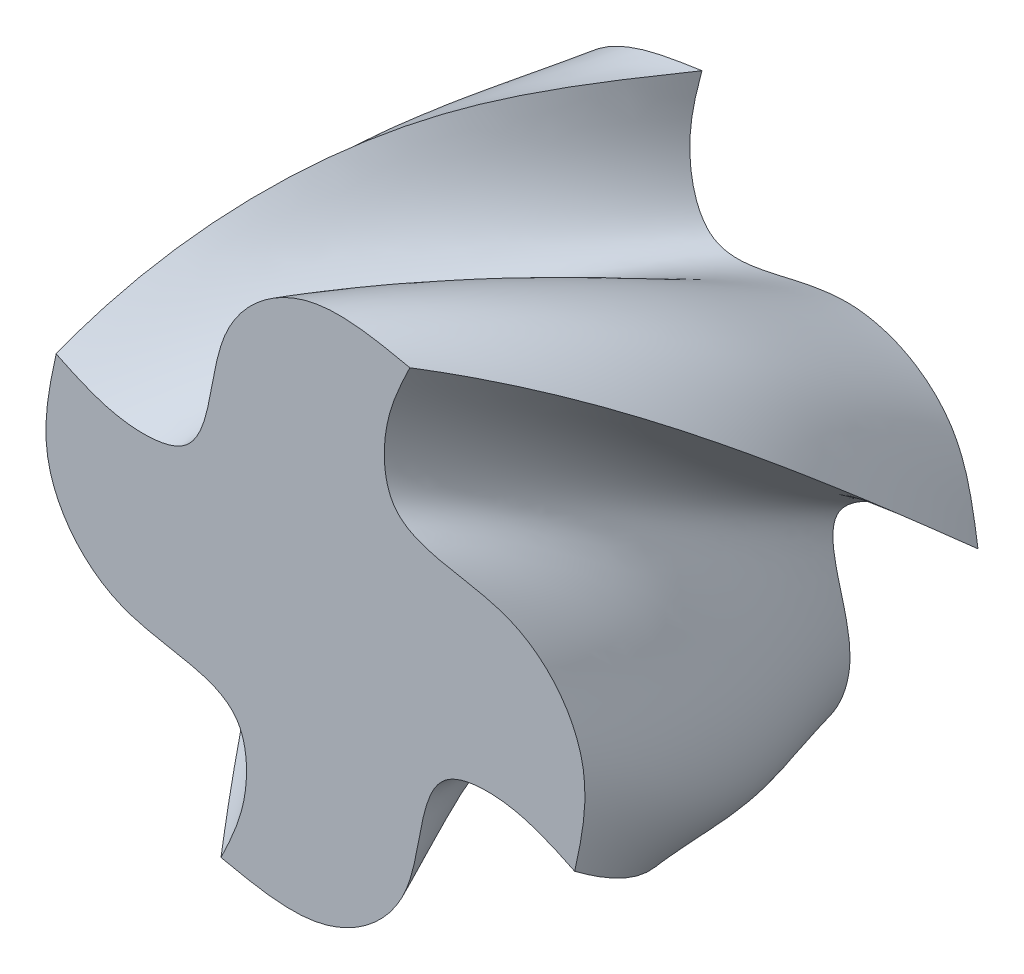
ISO-10303-21;
HEADER;
FILE_DESCRIPTION(('STEP AP214'),'2;1');
FILE_NAME('part.step','',(''),(''),'','','');
FILE_SCHEMA(('AUTOMOTIVE_DESIGN { 1 0 10303 214 1 1 1 1 }'));
ENDSEC;
DATA;
#1=APPLICATION_CONTEXT('core data for automotive mechanical design processes');
#2=APPLICATION_PROTOCOL_DEFINITION('international standard','automotive_design',2000,#1);
#3=PRODUCT_CONTEXT('',#1,'mechanical');
#4=PRODUCT('Part','Part','',(#3));
#5=PRODUCT_RELATED_PRODUCT_CATEGORY('part','',(#4));
#6=PRODUCT_DEFINITION_FORMATION('','',#4);
#7=PRODUCT_DEFINITION_CONTEXT('part definition',#1,'design');
#8=PRODUCT_DEFINITION('design','',#6,#7);
#9=PRODUCT_DEFINITION_SHAPE('','',#8);
#10=(LENGTH_UNIT() NAMED_UNIT(*) SI_UNIT(.MILLI.,.METRE.));
#11=(NAMED_UNIT(*) PLANE_ANGLE_UNIT() SI_UNIT($,.RADIAN.));
#12=(NAMED_UNIT(*) SI_UNIT($,.STERADIAN.) SOLID_ANGLE_UNIT());
#13=UNCERTAINTY_MEASURE_WITH_UNIT(LENGTH_MEASURE(1.E-05),#10,'distance_accuracy_value','');
#14=(GEOMETRIC_REPRESENTATION_CONTEXT(3) GLOBAL_UNCERTAINTY_ASSIGNED_CONTEXT((#13)) GLOBAL_UNIT_ASSIGNED_CONTEXT((#10,
#11,#12)) REPRESENTATION_CONTEXT('',''));
#15=CARTESIAN_POINT('',(0.,0.,0.));
#16=DIRECTION('',(0.,0.,1.));
#17=DIRECTION('',(1.,0.,0.));
#18=AXIS2_PLACEMENT_3D('',#15,#16,#17);
#19=CARTESIAN_POINT('',(20.,-1.39659334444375E-13,0.));
#20=CARTESIAN_POINT('',(19.6283413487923,2.90744055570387,3.33333333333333));
#21=CARTESIAN_POINT('',(18.8850240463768,8.72232166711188,10.));
#22=CARTESIAN_POINT('',(13.2168382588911,15.8249047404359,20.));
#23=CARTESIAN_POINT('',(5.38213608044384,19.9033925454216,30.));
#24=CARTESIAN_POINT('',(-3.68709716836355,20.4726242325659,40.));
#25=CARTESIAN_POINT('',(-8.87671820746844,17.7462353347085,46.6666666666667));
#26=CARTESIAN_POINT('',(-11.4715287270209,16.3830408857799,50.));
#27=CARTESIAN_POINT('',(19.6539494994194,2.49259329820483,0.));
#28=CARTESIAN_POINT('',(18.9263681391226,5.30340809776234,3.33333333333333));
#29=CARTESIAN_POINT('',(17.471205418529,10.9250376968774,10.));
#30=CARTESIAN_POINT('',(11.0159010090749,17.198304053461,20.));
#31=CARTESIAN_POINT('',(2.8084583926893,20.2297874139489,30.));
#32=CARTESIAN_POINT('',(-6.1747973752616,19.6588744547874,40.));
#33=CARTESIAN_POINT('',(-10.9348359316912,16.3328782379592,46.6666666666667));
#34=CARTESIAN_POINT('',(-13.314855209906,14.6698801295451,50.));
#35=CARTESIAN_POINT('',(18.9246701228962,7.74557482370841,0.));
#36=CARTESIAN_POINT('',(17.4470043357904,10.3527570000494,3.33333333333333));
#37=CARTESIAN_POINT('',(14.4916727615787,15.5671213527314,10.));
#38=CARTESIAN_POINT('',(6.37756601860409,20.092655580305,20.));
#39=CARTESIAN_POINT('',(-2.61540331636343,20.9176437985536,30.));
#40=CARTESIAN_POINT('',(-11.4174670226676,17.9439486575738,40.));
#41=CARTESIAN_POINT('',(-15.2721878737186,13.354318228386,46.6666666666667));
#42=CARTESIAN_POINT('',(-17.1995482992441,11.0595030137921,50.));
#43=CARTESIAN_POINT('',(10.9898303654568,12.7132909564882,0.));
#44=CARTESIAN_POINT('',(8.93745020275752,14.074654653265,3.33333333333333));
#45=CARTESIAN_POINT('',(4.83268987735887,16.7973820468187,10.));
#46=CARTESIAN_POINT('',(-2.79679039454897,17.0971264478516,20.));
#47=CARTESIAN_POINT('',(-9.69444289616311,14.3579784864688,30.));
#48=CARTESIAN_POINT('',(-15.0397500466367,8.90577641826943,40.));
#49=CARTESIAN_POINT('',(-16.1583340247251,4.1087907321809,46.6666666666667));
#50=CARTESIAN_POINT('',(-16.7176260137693,1.71029788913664,50.));
#51=CARTESIAN_POINT('',(2.29990278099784,8.50501357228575,0.));
#52=CARTESIAN_POINT('',(1.02077277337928,8.68130700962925,3.33333333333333));
#53=CARTESIAN_POINT('',(-1.53748724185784,9.03389388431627,10.));
#54=CARTESIAN_POINT('',(-5.20967932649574,7.44025655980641,20.));
#55=CARTESIAN_POINT('',(-7.84501169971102,4.57755041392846,30.));
#56=CARTESIAN_POINT('',(-9.12999559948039,0.786311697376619,40.));
#57=CARTESIAN_POINT('',(-8.56737806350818,-1.7340996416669,46.6666666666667));
#58=CARTESIAN_POINT('',(-8.28606929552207,-2.99430531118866,50.));
#59=CARTESIAN_POINT('',(-0.462040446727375,15.2791271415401,0.));
#60=CARTESIAN_POINT('',(-2.67461207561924,14.9280283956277,3.33333333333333));
#61=CARTESIAN_POINT('',(-7.09975533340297,14.225830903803,10.));
#62=CARTESIAN_POINT('',(-12.3948722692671,9.73150030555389,20.));
#63=CARTESIAN_POINT('',(-15.3296614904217,3.65190845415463,30.));
#64=CARTESIAN_POINT('',(-15.5550120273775,-3.28974034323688,40.));
#65=CARTESIAN_POINT('',(-13.3522791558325,-7.19139922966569,46.6666666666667));
#66=CARTESIAN_POINT('',(-12.25091272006,-9.14222867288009,50.));
#67=CARTESIAN_POINT('',(-0.159631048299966,18.3689785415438,0.));
#68=CARTESIAN_POINT('',(-2.82700029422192,18.0044231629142,3.33333333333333));
#69=CARTESIAN_POINT('',(-8.16173878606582,17.2753124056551,10.));
#70=CARTESIAN_POINT('',(-14.6398576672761,12.0126836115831,20.));
#71=CARTESIAN_POINT('',(-18.3232073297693,4.78435713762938,30.));
#72=CARTESIAN_POINT('',(-18.7736310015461,-3.54981376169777,40.));
#73=CARTESIAN_POINT('',(-16.2281608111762,-8.29445482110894,46.6666666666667));
#74=CARTESIAN_POINT('',(-14.9554257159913,-10.6667753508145,50.));
#75=CARTESIAN_POINT('',(0.,20.,0.));
#76=CARTESIAN_POINT('',(-2.90744055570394,19.6283413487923,3.33333333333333));
#77=CARTESIAN_POINT('',(-8.72232166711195,18.8850240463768,10.));
#78=CARTESIAN_POINT('',(-15.8249047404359,13.2168382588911,20.));
#79=CARTESIAN_POINT('',(-19.9033925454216,5.38213608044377,30.));
#80=CARTESIAN_POINT('',(-20.4726242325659,-3.68709716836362,40.));
#81=CARTESIAN_POINT('',(-17.7462353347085,-8.87671820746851,46.6666666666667));
#82=CARTESIAN_POINT('',(-16.3830408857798,-11.4715287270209,50.));
#83=B_SPLINE_SURFACE_WITH_KNOTS('',3,3,((#19,#20,#21,#22,#23,#24,#25,#26),(#27,#28,#29,#30,#31,
#32,#33,#34),(#35,#36,#37,#38,#39,#40,#41,#42),(#43,#44,#45,#46,#47,#48,#49,#50),(#51,#52,#53,
#54,#55,#56,#57,#58),(#59,#60,#61,#62,#63,#64,#65,#66),(#67,#68,#69,#70,#71,#72,#73,#74),(#75,
#76,#77,#78,#79,#80,#81,#82)),.UNSPECIFIED.,.F.,.F.,.F.,(4,1,1,1,1,4),(4,1,1,1,1,4),(0.,
0.215295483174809,0.453721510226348,0.719879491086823,0.852134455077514,1.),(0.,0.2,0.4,0.6,0.8,
1.),.UNSPECIFIED.);
#84=CARTESIAN_POINT('',(6.84084117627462,18.7842063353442,28.));
#85=CARTESIAN_POINT('',(6.64747240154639,18.8256816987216,28.));
#86=CARTESIAN_POINT('',(6.45410010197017,18.8671630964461,28.));
#87=CARTESIAN_POINT('',(6.06559066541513,18.9494841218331,28.));
#88=CARTESIAN_POINT('',(5.87045186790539,18.9903158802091,28.));
#89=CARTESIAN_POINT('',(5.47869373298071,19.0702011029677,28.));
#90=CARTESIAN_POINT('',(5.2820721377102,19.1092436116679,28.));
#91=CARTESIAN_POINT('',(4.88762494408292,19.1843562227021,28.));
#92=CARTESIAN_POINT('',(4.68979750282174,19.220416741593,28.));
#93=CARTESIAN_POINT('',(4.29320526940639,19.2883264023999,28.));
#94=CARTESIAN_POINT('',(4.09443972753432,19.3201712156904,28.));
#95=CARTESIAN_POINT('',(3.69169806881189,19.3790326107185,28.));
#96=CARTESIAN_POINT('',(3.48770382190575,19.405927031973,28.));
#97=CARTESIAN_POINT('',(3.07925775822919,19.4525690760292,28.));
#98=CARTESIAN_POINT('',(2.87480743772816,19.4723295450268,28.));
#99=CARTESIAN_POINT('',(2.46570983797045,19.5032665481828,28.));
#100=CARTESIAN_POINT('',(2.26106409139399,19.5144627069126,28.));
#101=CARTESIAN_POINT('',(1.8518397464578,19.5268126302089,28.));
#102=CARTESIAN_POINT('',(1.64726177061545,19.5279855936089,28.));
#103=CARTESIAN_POINT('',(1.23842419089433,19.5188158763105,28.));
#104=CARTESIAN_POINT('',(1.03416448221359,19.5084786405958,28.));
#105=CARTESIAN_POINT('',(0.664836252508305,19.4780102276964,28.));
#106=CARTESIAN_POINT('',(0.499586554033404,19.4600737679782,28.));
#107=CARTESIAN_POINT('',(0.170236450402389,19.414959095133,28.));
#108=CARTESIAN_POINT('',(0.00613670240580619,19.3877759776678,28.));
#109=CARTESIAN_POINT('',(-0.238556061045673,19.3396817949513,28.));
#110=CARTESIAN_POINT('',(-0.319880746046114,19.3224296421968,28.));
#111=CARTESIAN_POINT('',(-0.481961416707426,19.2854342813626,28.));
#112=CARTESIAN_POINT('',(-0.562717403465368,19.2656910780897,28.));
#113=CARTESIAN_POINT('',(-0.802727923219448,19.203143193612,28.));
#114=CARTESIAN_POINT('',(-0.961062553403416,19.1567566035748,28.));
#115=CARTESIAN_POINT('',(-1.2747634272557,19.0548140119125,28.));
#116=CARTESIAN_POINT('',(-1.43012922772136,18.9992566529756,28.));
#117=CARTESIAN_POINT('',(-1.73743905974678,18.8793744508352,28.));
#118=CARTESIAN_POINT('',(-1.88938290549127,18.8150491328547,28.));
#119=CARTESIAN_POINT('',(-2.26439326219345,18.6437607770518,28.));
#120=CARTESIAN_POINT('',(-2.4850834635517,18.5315472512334,28.));
#121=CARTESIAN_POINT('',(-2.91645791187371,18.2893995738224,28.));
#122=CARTESIAN_POINT('',(-3.12714294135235,18.1594668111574,28.));
#123=CARTESIAN_POINT('',(-3.53820792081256,17.8822524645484,28.));
#124=CARTESIAN_POINT('',(-3.73853533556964,17.7348929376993,28.));
#125=CARTESIAN_POINT('',(-4.12648840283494,17.4243049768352,28.));
#126=CARTESIAN_POINT('',(-4.31411387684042,17.2610763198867,28.));
#127=CARTESIAN_POINT('',(-4.68016534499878,16.9151326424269,28.));
#128=CARTESIAN_POINT('',(-4.85820801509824,16.7320115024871,28.));
#129=CARTESIAN_POINT('',(-5.19797329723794,16.3511547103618,28.));
#130=CARTESIAN_POINT('',(-5.35969392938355,16.1534172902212,28.));
#131=CARTESIAN_POINT('',(-5.66467255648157,15.7453849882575,28.));
#132=CARTESIAN_POINT('',(-5.80800044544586,15.5351423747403,28.));
#133=CARTESIAN_POINT('',(-6.07542648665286,15.1028424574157,28.));
#134=CARTESIAN_POINT('',(-6.19953258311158,14.8807900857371,28.));
#135=CARTESIAN_POINT('',(-6.38566258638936,14.509441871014,28.));
#136=CARTESIAN_POINT('',(-6.45380796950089,14.3631868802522,28.));
#137=CARTESIAN_POINT('',(-6.54958280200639,14.1410530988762,28.));
#138=CARTESIAN_POINT('',(-6.58043238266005,14.0665540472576,28.));
#139=CARTESIAN_POINT('',(-6.64003247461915,13.9167202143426,28.));
#140=CARTESIAN_POINT('',(-6.66878293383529,13.8413854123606,28.));
#141=CARTESIAN_POINT('',(-6.75217673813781,13.6142354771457,28.));
#142=CARTESIAN_POINT('',(-6.80392856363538,13.4613545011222,28.));
#143=CARTESIAN_POINT('',(-6.90093131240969,13.1535504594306,28.));
#144=CARTESIAN_POINT('',(-6.9461813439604,12.9986271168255,28.));
#145=CARTESIAN_POINT('',(-7.03110167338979,12.6883151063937,28.));
#146=CARTESIAN_POINT('',(-7.07080518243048,12.5329354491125,28.));
#147=CARTESIAN_POINT('',(-7.14607390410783,12.2211950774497,28.));
#148=CARTESIAN_POINT('',(-7.18163931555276,12.0648344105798,28.));
#149=CARTESIAN_POINT('',(-7.28373336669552,11.5947719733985,28.));
#150=CARTESIAN_POINT('',(-7.34566080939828,11.2800859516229,28.));
#151=CARTESIAN_POINT('',(-7.4483841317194,10.7399505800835,28.));
#152=CARTESIAN_POINT('',(-7.49016538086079,10.5146741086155,28.));
#153=CARTESIAN_POINT('',(-7.57478164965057,10.0643158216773,28.));
#154=CARTESIAN_POINT('',(-7.6176166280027,9.83923399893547,28.));
#155=CARTESIAN_POINT('',(-7.70782028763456,9.38991910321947,28.));
#156=CARTESIAN_POINT('',(-7.75518982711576,9.16568619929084,28.));
#157=CARTESIAN_POINT('',(-7.85857514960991,8.71922244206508,28.));
#158=CARTESIAN_POINT('',(-7.91458761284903,8.49699085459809,28.));
#159=CARTESIAN_POINT('',(-8.01370702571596,8.15026629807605,28.));
#160=CARTESIAN_POINT('',(-8.05215178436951,8.0244532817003,28.));
#161=CARTESIAN_POINT('',(-8.13484446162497,7.7747635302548,28.));
#162=CARTESIAN_POINT('',(-8.1790908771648,7.65088630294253,28.));
#163=CARTESIAN_POINT('',(-8.27475989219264,7.40592752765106,28.));
#164=CARTESIAN_POINT('',(-8.32618036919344,7.28484516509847,28.));
#165=CARTESIAN_POINT('',(-8.43765535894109,7.04678068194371,28.));
#166=CARTESIAN_POINT('',(-8.49770625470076,6.92979686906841,28.));
#167=CARTESIAN_POINT('',(-8.65551855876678,6.6534800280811,28.));
#168=CARTESIAN_POINT('',(-8.75852434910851,6.49700090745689,28.));
#169=CARTESIAN_POINT('',(-8.93063515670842,6.2764263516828,28.));
#170=CARTESIAN_POINT('',(-8.9908557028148,6.20533630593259,28.));
#171=CARTESIAN_POINT('',(-9.11727043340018,6.06871116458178,28.));
#172=CARTESIAN_POINT('',(-9.1834615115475,6.00317321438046,28.));
#173=CARTESIAN_POINT('',(-9.3222224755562,5.87802612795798,28.));
#174=CARTESIAN_POINT('',(-9.39483897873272,5.81846838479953,28.));
#175=CARTESIAN_POINT('',(-9.50777665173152,5.73459499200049,28.));
#176=CARTESIAN_POINT('',(-9.54609398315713,5.70754615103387,28.));
#177=CARTESIAN_POINT('',(-9.623992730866,5.65533086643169,28.));
#178=CARTESIAN_POINT('',(-9.66357418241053,5.6301644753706,28.));
#179=CARTESIAN_POINT('',(-9.78423301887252,5.55734949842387,28.));
#180=CARTESIAN_POINT('',(-9.86703107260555,5.51252830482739,28.));
#181=CARTESIAN_POINT('',(-10.0359994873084,5.42979863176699,28.));
#182=CARTESIAN_POINT('',(-10.1221712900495,5.39189314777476,28.));
#183=CARTESIAN_POINT('',(-10.337839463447,5.30609455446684,28.));
#184=CARTESIAN_POINT('',(-10.4687716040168,5.26180651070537,28.));
#185=CARTESIAN_POINT('',(-10.7339501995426,5.18475615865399,28.));
#186=CARTESIAN_POINT('',(-10.8681980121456,5.15199865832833,28.));
#187=CARTESIAN_POINT('',(-11.1389817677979,5.09631911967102,28.));
#188=CARTESIAN_POINT('',(-11.2755219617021,5.07341809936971,28.));
#189=CARTESIAN_POINT('',(-11.5497974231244,5.03622869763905,28.));
#190=CARTESIAN_POINT('',(-11.6875331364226,5.02194368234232,28.));
#191=CARTESIAN_POINT('',(-11.9527536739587,5.00179760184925,28.));
#192=CARTESIAN_POINT('',(-12.0801965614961,4.99536444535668,28.));
#193=CARTESIAN_POINT('',(-12.3352593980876,4.98833994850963,28.));
#194=CARTESIAN_POINT('',(-12.4628793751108,4.98774967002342,28.));
#195=CARTESIAN_POINT('',(-12.7181129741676,4.99194402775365,28.));
#196=CARTESIAN_POINT('',(-12.8457265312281,4.99673236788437,28.));
#197=CARTESIAN_POINT('',(-13.1006660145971,5.01134437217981,28.));
#198=CARTESIAN_POINT('',(-13.2279919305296,5.02116821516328,28.));
#199=CARTESIAN_POINT('',(-13.4825881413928,5.04565595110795,28.));
#200=CARTESIAN_POINT('',(-13.6098569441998,5.06033528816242,28.));
#201=CARTESIAN_POINT('',(-13.8637598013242,5.09439328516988,28.));
#202=CARTESIAN_POINT('',(-13.9903938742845,5.11377180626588,28.));
#203=CARTESIAN_POINT('',(-14.2427590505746,5.15718710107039,28.));
#204=CARTESIAN_POINT('',(-14.3684907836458,5.18122021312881,28.));
#205=CARTESIAN_POINT('',(-14.6190076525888,5.23377104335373,28.));
#206=CARTESIAN_POINT('',(-14.7437927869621,5.26228876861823,28.));
#207=CARTESIAN_POINT('',(-15.097081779,5.34942216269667,28.));
#208=CARTESIAN_POINT('',(-15.324339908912,5.41314393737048,28.));
#209=CARTESIAN_POINT('',(-15.7751003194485,5.55321505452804,28.));
#210=CARTESIAN_POINT('',(-15.9985989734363,5.62957589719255,28.));
#211=CARTESIAN_POINT('',(-16.4420956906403,5.79269516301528,28.));
#212=CARTESIAN_POINT('',(-16.6620883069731,5.87946825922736,28.));
#213=CARTESIAN_POINT('',(-17.095815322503,6.05954791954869,28.));
#214=CARTESIAN_POINT('',(-17.3095941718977,6.15274856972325,28.));
#215=CARTESIAN_POINT('',(-17.7345419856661,6.34405951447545,28.));
#216=CARTESIAN_POINT('',(-17.9457142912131,6.44216247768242,28.));
#217=CARTESIAN_POINT('',(-18.3660011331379,6.64046460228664,28.));
#218=CARTESIAN_POINT('',(-18.5751205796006,6.74065330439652,28.));
#219=CARTESIAN_POINT('',(-18.7842063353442,6.84084117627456,28.));
#220=B_SPLINE_CURVE_WITH_KNOTS('',3,(#84,#85,#86,#87,#88,#89,#90,#91,#92,#93,#94,#95,#96,#97,
#98,#99,#100,#101,#102,#103,#104,#105,#106,#107,#108,#109,#110,#111,#112,#113,#114,#115,#116,
#117,#118,#119,#120,#121,#122,#123,#124,#125,#126,#127,#128,#129,#130,#131,#132,#133,#134,#135,
#136,#137,#138,#139,#140,#141,#142,#143,#144,#145,#146,#147,#148,#149,#150,#151,#152,#153,#154,
#155,#156,#157,#158,#159,#160,#161,#162,#163,#164,#165,#166,#167,#168,#169,#170,#171,#172,#173,
#174,#175,#176,#177,#178,#179,#180,#181,#182,#183,#184,#185,#186,#187,#188,#189,#190,#191,#192,
#193,#194,#195,#196,#197,#198,#199,#200,#201,#202,#203,#204,#205,#206,#207,#208,#209,#210,#211,
#212,#213,#214,#215,#216,#217,#218,#219),.UNSPECIFIED.,.F.,.F.,(4,2,2,2,2,2,2,2,2,2,2,2,2,2,2,2,
2,2,2,2,2,2,2,2,2,2,2,2,2,2,2,2,2,2,2,2,2,2,2,2,2,2,2,2,2,2,2,2,2,2,2,2,2,2,2,2,2,2,2,2,2,2,2,2,
2,2,2,4),(0.,0.593308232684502,1.1913993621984,1.79276384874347,2.39599140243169,
2.99983361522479,3.61701137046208,4.23307215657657,4.84771701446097,5.46118429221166,
6.0743614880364,6.57279521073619,7.07149371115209,7.32086301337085,7.57023183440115,
8.06488653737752,8.55961451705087,9.05436929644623,9.79620534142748,10.5379832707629,
11.2832141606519,12.0284555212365,12.7937473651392,13.5591319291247,14.3215159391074,
15.0835840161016,15.5673773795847,15.8092479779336,16.0511245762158,16.5351372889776,
17.0192163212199,17.5002596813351,17.9812799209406,18.9433085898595,19.6306800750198,
20.3180246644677,21.0054995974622,21.6927111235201,22.0872688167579,22.4817244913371,
22.8760637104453,23.2702381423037,23.8299984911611,24.1092042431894,24.3882655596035,
24.6695500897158,24.8102106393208,24.9508751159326,25.2329239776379,25.5150947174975,
25.9290671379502,26.3432119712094,26.7582356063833,27.1734212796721,27.5560928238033,
27.938833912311,28.3218387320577,28.7048571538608,29.0891057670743,29.4733430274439,
29.8572792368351,30.2412160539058,30.9488194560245,31.657070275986,32.3663311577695,
33.0658656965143,33.7643836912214,34.4599859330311),.UNSPECIFIED.);
#221=CARTESIAN_POINT('',(6.84084117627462,18.7842063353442,28.));
#222=VERTEX_POINT('',#221);
#223=CARTESIAN_POINT('',(-18.7842063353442,6.84084117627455,28.));
#224=VERTEX_POINT('',#223);
#225=EDGE_CURVE('E171',#222,#224,#220,.T.);
#226=CARTESIAN_POINT('',(20.,-1.39659334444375E-13,0.));
#227=CARTESIAN_POINT('',(19.6283413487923,2.90744055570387,3.33333333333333));
#228=CARTESIAN_POINT('',(18.8850240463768,8.72232166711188,10.));
#229=CARTESIAN_POINT('',(13.2168382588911,15.8249047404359,20.));
#230=CARTESIAN_POINT('',(5.38213608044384,19.9033925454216,30.));
#231=CARTESIAN_POINT('',(-3.68709716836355,20.4726242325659,40.));
#232=CARTESIAN_POINT('',(-8.87671820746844,17.7462353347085,46.6666666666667));
#233=CARTESIAN_POINT('',(-11.4715287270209,16.3830408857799,50.));
#234=B_SPLINE_CURVE_WITH_KNOTS('',3,(#226,#227,#228,#229,#230,#231,#232,#233),.UNSPECIFIED.,.F.,
.F.,(4,1,1,1,1,4),(0.,0.2,0.4,0.6,0.8,1.),.UNSPECIFIED.);
#235=CARTESIAN_POINT('',(20.,-1.39659334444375E-13,0.));
#236=VERTEX_POINT('',#235);
#237=EDGE_CURVE('E85',#222,#236,#234,.F.);
#238=CARTESIAN_POINT('',(0.,20.,0.));
#239=CARTESIAN_POINT('',(-0.048416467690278,19.7430167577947,0.0270120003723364));
#240=CARTESIAN_POINT('',(-0.0959561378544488,19.4857910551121,0.0540271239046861));
#241=CARTESIAN_POINT('',(-0.185969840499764,18.9685941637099,0.10831491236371));
#242=CARTESIAN_POINT('',(-0.228405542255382,18.7086164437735,0.135588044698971));
#243=CARTESIAN_POINT('',(-0.304199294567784,18.1866632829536,0.190327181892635));
#244=CARTESIAN_POINT('',(-0.33753531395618,17.9246845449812,0.217793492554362));
#245=CARTESIAN_POINT('',(-0.391367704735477,17.3984409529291,0.27297546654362));
#246=CARTESIAN_POINT('',(-0.411818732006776,17.1341713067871,0.300691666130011));
#247=CARTESIAN_POINT('',(-0.436099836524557,16.6054540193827,0.356180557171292));
#248=CARTESIAN_POINT('',(-0.439969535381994,16.3410083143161,0.383952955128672));
#249=CARTESIAN_POINT('',(-0.428130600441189,15.8128795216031,0.439475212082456));
#250=CARTESIAN_POINT('',(-0.412453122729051,15.5491958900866,0.467225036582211));
#251=CARTESIAN_POINT('',(-0.370349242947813,15.1329586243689,0.511070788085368));
#252=CARTESIAN_POINT('',(-0.351076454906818,14.979666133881,0.527227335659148));
#253=CARTESIAN_POINT('',(-0.304885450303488,14.6741597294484,0.559436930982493));
#254=CARTESIAN_POINT('',(-0.27796448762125,14.5219462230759,0.575489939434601));
#255=CARTESIAN_POINT('',(-0.21640764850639,14.2190757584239,0.607429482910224));
#256=CARTESIAN_POINT('',(-0.181772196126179,14.0684187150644,0.623316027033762));
#257=CARTESIAN_POINT('',(-0.104446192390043,13.7691735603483,0.654849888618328));
#258=CARTESIAN_POINT('',(-0.0617568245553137,13.6205851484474,0.670497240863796));
#259=CARTESIAN_POINT('',(0.0325757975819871,13.3250318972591,0.701572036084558));
#260=CARTESIAN_POINT('',(0.0842819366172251,13.1780867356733,0.716997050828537));
#261=CARTESIAN_POINT('',(0.197268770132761,12.8877920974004,0.74737828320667));
#262=CARTESIAN_POINT('',(0.258552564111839,12.7444438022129,0.762334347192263));
#263=CARTESIAN_POINT('',(0.391747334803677,12.4627758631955,0.791568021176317));
#264=CARTESIAN_POINT('',(0.463650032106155,12.3244524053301,0.805846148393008));
#265=CARTESIAN_POINT('',(0.6194416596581,12.0547448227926,0.833438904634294));
#266=CARTESIAN_POINT('',(0.703320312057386,11.923354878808,0.846754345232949));
#267=CARTESIAN_POINT('',(0.89607149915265,11.6544618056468,0.873591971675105));
#268=CARTESIAN_POINT('',(1.00674885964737,11.5181920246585,0.886938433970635));
#269=CARTESIAN_POINT('',(1.18721135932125,11.3277496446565,0.904989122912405));
#270=CARTESIAN_POINT('',(1.24966563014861,11.2666795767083,0.910670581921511));
#271=CARTESIAN_POINT('',(1.37962814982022,11.150078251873,0.92125126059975));
#272=CARTESIAN_POINT('',(1.44713492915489,11.0945453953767,0.926150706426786));
#273=CARTESIAN_POINT('',(1.58802382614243,10.9896639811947,0.935055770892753));
#274=CARTESIAN_POINT('',(1.66146214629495,10.9403897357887,0.939051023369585));
#275=CARTESIAN_POINT('',(1.81284672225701,10.8492415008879,0.946006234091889));
#276=CARTESIAN_POINT('',(1.89079368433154,10.8073686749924,0.948966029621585));
#277=CARTESIAN_POINT('',(2.05039710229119,10.7310018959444,0.953842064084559));
#278=CARTESIAN_POINT('',(2.13205952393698,10.6965203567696,0.955756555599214));
#279=CARTESIAN_POINT('',(2.29810684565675,10.6347267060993,0.958566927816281));
#280=CARTESIAN_POINT('',(2.38249355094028,10.6074194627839,0.959462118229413));
#281=CARTESIAN_POINT('',(2.58247495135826,10.5512211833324,0.960441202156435));
#282=CARTESIAN_POINT('',(2.69882411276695,10.5250136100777,0.960140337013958));
#283=CARTESIAN_POINT('',(2.93331299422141,10.4829684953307,0.95802698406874));
#284=CARTESIAN_POINT('',(3.05145302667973,10.4671327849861,0.956214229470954));
#285=CARTESIAN_POINT('',(3.28889076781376,10.4440323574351,0.95129707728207));
#286=CARTESIAN_POINT('',(3.40819099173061,10.4367956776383,0.94818849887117));
#287=CARTESIAN_POINT('',(3.64691819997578,10.4293657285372,0.940891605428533));
#288=CARTESIAN_POINT('',(3.7663451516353,10.4291709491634,0.936703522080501));
#289=CARTESIAN_POINT('',(4.06218339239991,10.4356544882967,0.925211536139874));
#290=CARTESIAN_POINT('',(4.23849291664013,10.4456691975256,0.917376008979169));
#291=CARTESIAN_POINT('',(4.5904144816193,10.4743311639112,0.900218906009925));
#292=CARTESIAN_POINT('',(4.76602581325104,10.4929856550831,0.890896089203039));
#293=CARTESIAN_POINT('',(5.11652688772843,10.5361567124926,0.871121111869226));
#294=CARTESIAN_POINT('',(5.29141623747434,10.560676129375,0.860668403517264));
#295=CARTESIAN_POINT('',(5.64058541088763,10.6133933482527,0.838909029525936));
#296=CARTESIAN_POINT('',(5.81486518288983,10.6415914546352,0.827602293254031));
#297=CARTESIAN_POINT('',(6.16295294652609,10.6998839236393,0.80435338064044));
#298=CARTESIAN_POINT('',(6.33676115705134,10.729977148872,0.792411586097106));
#299=CARTESIAN_POINT('',(6.68425618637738,10.7905831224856,0.76805428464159));
#300=CARTESIAN_POINT('',(6.85794301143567,10.8210958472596,0.755638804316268));
#301=CARTESIAN_POINT('',(7.37064148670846,10.9097824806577,0.71851359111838));
#302=CARTESIAN_POINT('',(7.70986206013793,10.9666788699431,0.693335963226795));
#303=CARTESIAN_POINT('',(8.22020631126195,11.0425654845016,0.655248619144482));
#304=CARTESIAN_POINT('',(8.39062203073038,11.0662901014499,0.642495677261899));
#305=CARTESIAN_POINT('',(8.73207472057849,11.109431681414,0.616973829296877));
#306=CARTESIAN_POINT('',(8.90311191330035,11.1288469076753,0.604204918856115));
#307=CARTESIAN_POINT('',(9.27687021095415,11.1651610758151,0.576442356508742));
#308=CARTESIAN_POINT('',(9.47970284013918,11.1809622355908,0.561465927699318));
#309=CARTESIAN_POINT('',(9.88594083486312,11.2026428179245,0.531806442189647));
#310=CARTESIAN_POINT('',(10.0893461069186,11.2085237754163,0.517123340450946));
#311=CARTESIAN_POINT('',(10.3944184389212,11.2081347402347,0.495465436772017));
#312=CARTESIAN_POINT('',(10.4960846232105,11.2064711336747,0.488308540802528));
#313=CARTESIAN_POINT('',(10.6993166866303,11.1997273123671,0.474144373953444));
#314=CARTESIAN_POINT('',(10.800882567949,11.1946471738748,0.467137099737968));
#315=CARTESIAN_POINT('',(11.0035416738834,11.180944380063,0.453302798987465));
#316=CARTESIAN_POINT('',(11.1046354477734,11.172330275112,0.446475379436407));
#317=CARTESIAN_POINT('',(11.3064749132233,11.1516246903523,0.432981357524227));
#318=CARTESIAN_POINT('',(11.4072205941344,11.1395331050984,0.42631476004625));
#319=CARTESIAN_POINT('',(11.7088884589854,11.0980619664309,0.406549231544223));
#320=CARTESIAN_POINT('',(11.909139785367,11.0634929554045,0.3936914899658));
#321=CARTESIAN_POINT('',(12.306865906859,10.980886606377,0.368623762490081));
#322=CARTESIAN_POINT('',(12.5043404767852,10.9328481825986,0.356413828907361));
#323=CARTESIAN_POINT('',(12.9698068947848,10.8030264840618,0.328134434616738));
#324=CARTESIAN_POINT('',(13.2361955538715,10.7153529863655,0.312353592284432));
#325=CARTESIAN_POINT('',(13.7599522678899,10.516371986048,0.282012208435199));
#326=CARTESIAN_POINT('',(14.0173223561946,10.4050698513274,0.267451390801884));
#327=CARTESIAN_POINT('',(14.522335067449,10.1594944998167,0.239478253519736));
#328=CARTESIAN_POINT('',(14.7699296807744,10.0251219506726,0.226071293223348));
#329=CARTESIAN_POINT('',(15.2523037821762,9.73496729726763,0.200488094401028));
#330=CARTESIAN_POINT('',(15.4870833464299,9.5791853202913,0.188311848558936));
#331=CARTESIAN_POINT('',(15.9290958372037,9.25675313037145,0.165872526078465));
#332=CARTESIAN_POINT('',(16.1371356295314,9.09121304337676,0.155540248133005));
#333=CARTESIAN_POINT('',(16.538345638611,8.74315703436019,0.13605171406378));
#334=CARTESIAN_POINT('',(16.7315245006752,8.56065112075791,0.12689477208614));
#335=CARTESIAN_POINT('',(17.1003367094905,8.18051419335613,0.109869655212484));
#336=CARTESIAN_POINT('',(17.2760609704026,7.98297217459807,0.101994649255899));
#337=CARTESIAN_POINT('',(17.5257644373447,7.67549293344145,0.0911867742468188));
#338=CARTESIAN_POINT('',(17.6066817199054,7.57114384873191,0.0877517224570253));
#339=CARTESIAN_POINT('',(17.7636487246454,7.35882097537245,0.0812306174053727));
#340=CARTESIAN_POINT('',(17.839698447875,7.25084718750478,0.0781445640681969));
#341=CARTESIAN_POINT('',(17.9835923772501,7.03587894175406,0.0724627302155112));
#342=CARTESIAN_POINT('',(18.0516447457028,6.92902415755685,0.0698520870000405));
#343=CARTESIAN_POINT('',(18.1829065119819,6.71238578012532,0.0649631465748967));
#344=CARTESIAN_POINT('',(18.2461159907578,6.60260223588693,0.0626848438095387));
#345=CARTESIAN_POINT('',(18.4286426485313,6.26932371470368,0.0563101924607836));
#346=CARTESIAN_POINT('',(18.5408612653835,6.04189600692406,0.052673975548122));
#347=CARTESIAN_POINT('',(18.7485004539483,5.57732757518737,0.0463671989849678));
#348=CARTESIAN_POINT('',(18.8437737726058,5.34012186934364,0.043704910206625));
#349=CARTESIAN_POINT('',(19.0185310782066,4.85993148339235,0.0390980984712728));
#350=CARTESIAN_POINT('',(19.098010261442,4.6169450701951,0.0371537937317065));
#351=CARTESIAN_POINT('',(19.2421196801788,4.13194817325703,0.0337206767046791));
#352=CARTESIAN_POINT('',(19.3070151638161,3.89001541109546,0.0322235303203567));
#353=CARTESIAN_POINT('',(19.4263499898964,3.40351748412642,0.0293598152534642));
#354=CARTESIAN_POINT('',(19.4807851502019,3.15895130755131,0.0279932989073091));
#355=CARTESIAN_POINT('',(19.5815297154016,2.66797811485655,0.0251342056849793));
#356=CARTESIAN_POINT('',(19.6278326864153,2.4215698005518,0.0236415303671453));
#357=CARTESIAN_POINT('',(19.7134373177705,1.93358403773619,0.020334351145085));
#358=CARTESIAN_POINT('',(19.752879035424,1.69203069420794,0.0185283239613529));
#359=CARTESIAN_POINT('',(19.8279670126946,1.20857308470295,0.0143707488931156));
#360=CARTESIAN_POINT('',(19.863616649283,0.96666932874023,0.0120196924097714));
#361=CARTESIAN_POINT('',(19.9328697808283,0.483173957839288,0.00659556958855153));
#362=CARTESIAN_POINT('',(19.9664780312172,0.241583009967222,0.00352426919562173));
#363=CARTESIAN_POINT('',(20.,-1.39659334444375E-13,0.));
#364=B_SPLINE_CURVE_WITH_KNOTS('',3,(#238,#239,#240,#241,#242,#243,#244,#245,#246,#247,#248,
#249,#250,#251,#252,#253,#254,#255,#256,#257,#258,#259,#260,#261,#262,#263,#264,#265,#266,#267,
#268,#269,#270,#271,#272,#273,#274,#275,#276,#277,#278,#279,#280,#281,#282,#283,#284,#285,#286,
#287,#288,#289,#290,#291,#292,#293,#294,#295,#296,#297,#298,#299,#300,#301,#302,#303,#304,#305,
#306,#307,#308,#309,#310,#311,#312,#313,#314,#315,#316,#317,#318,#319,#320,#321,#322,#323,#324,
#325,#326,#327,#328,#329,#330,#331,#332,#333,#334,#335,#336,#337,#338,#339,#340,#341,#342,#343,
#344,#345,#346,#347,#348,#349,#350,#351,#352,#353,#354,#355,#356,#357,#358,#359,#360,#361,#362,
#363),.UNSPECIFIED.,.F.,.F.,(4,2,2,2,2,2,2,2,2,2,2,2,2,2,2,2,2,2,2,2,2,2,2,2,2,2,2,2,2,2,2,2,2,
2,2,2,2,2,2,2,2,2,2,2,2,2,2,2,2,2,2,2,2,2,2,2,2,2,2,2,2,2,4),(0.,0.788808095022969,
1.58321236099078,2.37952322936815,3.17862100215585,3.97580823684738,4.7717264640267,
5.2375812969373,5.70360360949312,6.16960031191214,6.63552858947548,7.10484675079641,
7.57431710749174,8.04342333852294,8.51212937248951,9.03844100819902,9.30078700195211,
9.56305698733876,9.828196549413,10.0933777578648,10.3590009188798,10.6248038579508,
10.9819944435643,11.339248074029,11.697663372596,12.0560018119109,12.5859582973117,
13.1163593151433,13.6470186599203,14.1777219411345,14.7081096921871,15.2384677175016,
16.2729790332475,16.7905294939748,17.3082881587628,17.9201009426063,18.5318190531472,
18.8375658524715,19.14330582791,19.4483103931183,19.7533242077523,20.3636576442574,
20.9740402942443,21.8154784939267,22.6567257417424,23.5016903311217,24.3466498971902,
25.1439055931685,25.9406939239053,26.7330866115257,27.1292466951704,27.5254066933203,
27.9054087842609,28.2854045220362,29.0453786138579,29.8116645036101,30.5781830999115,
31.3293673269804,32.080851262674,32.8329270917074,33.5671577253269,34.3007289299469,
35.0325199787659),.UNSPECIFIED.);
#365=CARTESIAN_POINT('',(0.,20.,0.));
#366=VERTEX_POINT('',#365);
#367=EDGE_CURVE('E91',#366,#236,#364,.T.);
#368=CARTESIAN_POINT('',(0.,20.,0.));
#369=CARTESIAN_POINT('',(-2.90744055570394,19.6283413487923,3.33333333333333));
#370=CARTESIAN_POINT('',(-8.72232166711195,18.8850240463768,10.));
#371=CARTESIAN_POINT('',(-15.8249047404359,13.2168382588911,20.));
#372=CARTESIAN_POINT('',(-19.9033925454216,5.38213608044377,30.));
#373=CARTESIAN_POINT('',(-20.4726242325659,-3.68709716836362,40.));
#374=CARTESIAN_POINT('',(-17.7462353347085,-8.87671820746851,46.6666666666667));
#375=CARTESIAN_POINT('',(-16.3830408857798,-11.4715287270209,50.));
#376=B_SPLINE_CURVE_WITH_KNOTS('',3,(#368,#369,#370,#371,#372,#373,#374,#375),.UNSPECIFIED.,.F.,
.F.,(4,1,1,1,1,4),(0.,0.2,0.4,0.6,0.8,1.),.UNSPECIFIED.);
#377=EDGE_CURVE('E110',#366,#224,#376,.T.);
#378=ORIENTED_EDGE('',*,*,#225,.F.);
#379=ORIENTED_EDGE('',*,*,#237,.T.);
#380=ORIENTED_EDGE('',*,*,#367,.F.);
#381=ORIENTED_EDGE('',*,*,#377,.T.);
#382=EDGE_LOOP('',(#378,#379,#380,#381));
#383=FACE_BOUND('',#382,.T.);
#384=ADVANCED_FACE('F31',(#383),#83,.T.);
#385=CARTESIAN_POINT('',(0.,20.,0.));
#386=CARTESIAN_POINT('',(-2.90744055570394,19.6283413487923,3.33333333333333));
#387=CARTESIAN_POINT('',(-8.72232166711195,18.8850240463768,10.));
#388=CARTESIAN_POINT('',(-15.8249047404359,13.2168382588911,20.));
#389=CARTESIAN_POINT('',(-19.9033925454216,5.38213608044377,30.));
#390=CARTESIAN_POINT('',(-20.4726242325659,-3.68709716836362,40.));
#391=CARTESIAN_POINT('',(-17.7462353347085,-8.87671820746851,46.6666666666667));
#392=CARTESIAN_POINT('',(-16.3830408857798,-11.4715287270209,50.));
#393=CARTESIAN_POINT('',(-2.4925932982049,19.6539494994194,0.));
#394=CARTESIAN_POINT('',(-5.30340809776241,18.9263681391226,3.33333333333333));
#395=CARTESIAN_POINT('',(-10.9250376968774,17.471205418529,10.));
#396=CARTESIAN_POINT('',(-17.1983040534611,11.0159010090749,20.));
#397=CARTESIAN_POINT('',(-20.2297874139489,2.80845839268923,30.));
#398=CARTESIAN_POINT('',(-19.6588744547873,-6.17479737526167,40.));
#399=CARTESIAN_POINT('',(-16.3328782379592,-10.9348359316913,46.6666666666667));
#400=CARTESIAN_POINT('',(-14.6698801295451,-13.3148552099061,50.));
#401=CARTESIAN_POINT('',(-7.74557482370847,18.9246701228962,0.));
#402=CARTESIAN_POINT('',(-10.3527570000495,17.4470043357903,3.33333333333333));
#403=CARTESIAN_POINT('',(-15.5671213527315,14.4916727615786,10.));
#404=CARTESIAN_POINT('',(-20.092655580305,6.37756601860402,20.));
#405=CARTESIAN_POINT('',(-20.9176437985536,-2.6154033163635,30.));
#406=CARTESIAN_POINT('',(-17.9439486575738,-11.4174670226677,40.));
#407=CARTESIAN_POINT('',(-13.3543182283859,-15.2721878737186,46.6666666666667));
#408=CARTESIAN_POINT('',(-11.059503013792,-17.1995482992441,50.));
#409=CARTESIAN_POINT('',(-12.7132909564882,10.9898303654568,0.));
#410=CARTESIAN_POINT('',(-14.074654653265,8.93745020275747,3.33333333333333));
#411=CARTESIAN_POINT('',(-16.7973820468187,4.83268987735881,10.));
#412=CARTESIAN_POINT('',(-17.0971264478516,-2.79679039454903,20.));
#413=CARTESIAN_POINT('',(-14.3579784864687,-9.69444289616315,30.));
#414=CARTESIAN_POINT('',(-8.90577641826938,-15.0397500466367,40.));
#415=CARTESIAN_POINT('',(-4.10879073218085,-16.1583340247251,46.6666666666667));
#416=CARTESIAN_POINT('',(-1.71029788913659,-16.7176260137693,50.));
#417=CARTESIAN_POINT('',(-8.50501357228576,2.2999027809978,0.));
#418=CARTESIAN_POINT('',(-8.68130700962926,1.02077277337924,3.33333333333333));
#419=CARTESIAN_POINT('',(-9.03389388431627,-1.53748724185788,10.));
#420=CARTESIAN_POINT('',(-7.44025655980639,-5.20967932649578,20.));
#421=CARTESIAN_POINT('',(-4.57755041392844,-7.84501169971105,30.));
#422=CARTESIAN_POINT('',(-0.786311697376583,-9.12999559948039,40.));
#423=CARTESIAN_POINT('',(1.73409964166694,-8.56737806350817,46.6666666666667));
#424=CARTESIAN_POINT('',(2.9943053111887,-8.28606929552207,50.));
#425=CARTESIAN_POINT('',(-15.2791271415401,-0.462040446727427,0.));
#426=CARTESIAN_POINT('',(-14.9280283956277,-2.67461207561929,3.33333333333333));
#427=CARTESIAN_POINT('',(-14.2258309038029,-7.09975533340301,10.));
#428=CARTESIAN_POINT('',(-9.73150030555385,-12.3948722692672,20.));
#429=CARTESIAN_POINT('',(-3.65190845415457,-15.3296614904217,30.));
#430=CARTESIAN_POINT('',(3.28974034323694,-15.5550120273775,40.));
#431=CARTESIAN_POINT('',(7.19139922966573,-13.3522791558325,46.6666666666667));
#432=CARTESIAN_POINT('',(9.14222867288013,-12.25091272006,50.));
#433=CARTESIAN_POINT('',(-18.3689785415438,-0.15963104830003,0.));
#434=CARTESIAN_POINT('',(-18.0044231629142,-2.82700029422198,3.33333333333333));
#435=CARTESIAN_POINT('',(-17.2753124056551,-8.16173878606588,10.));
#436=CARTESIAN_POINT('',(-12.012683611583,-14.6398576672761,20.));
#437=CARTESIAN_POINT('',(-4.78435713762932,-18.3232073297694,30.));
#438=CARTESIAN_POINT('',(3.54981376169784,-18.7736310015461,40.));
#439=CARTESIAN_POINT('',(8.29445482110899,-16.2281608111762,46.6666666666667));
#440=CARTESIAN_POINT('',(10.6667753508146,-14.9554257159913,50.));
#441=CARTESIAN_POINT('',(-20.,0.,0.));
#442=CARTESIAN_POINT('',(-19.6283413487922,-2.90744055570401,3.33333333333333));
#443=CARTESIAN_POINT('',(-18.8850240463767,-8.72232166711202,10.));
#444=CARTESIAN_POINT('',(-13.216838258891,-15.824904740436,20.));
#445=CARTESIAN_POINT('',(-5.3821360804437,-19.9033925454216,30.));
#446=CARTESIAN_POINT('',(3.6870971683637,-20.4726242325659,40.));
#447=CARTESIAN_POINT('',(8.87671820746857,-17.7462353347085,46.6666666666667));
#448=CARTESIAN_POINT('',(11.471528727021,-16.3830408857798,50.));
#449=B_SPLINE_SURFACE_WITH_KNOTS('',3,3,((#385,#386,#387,#388,#389,#390,#391,#392),(#393,#394,
#395,#396,#397,#398,#399,#400),(#401,#402,#403,#404,#405,#406,#407,#408),(#409,#410,#411,#412,
#413,#414,#415,#416),(#417,#418,#419,#420,#421,#422,#423,#424),(#425,#426,#427,#428,#429,#430,
#431,#432),(#433,#434,#435,#436,#437,#438,#439,#440),(#441,#442,#443,#444,#445,#446,#447,#448)),
.UNSPECIFIED.,.F.,.F.,.F.,(4,1,1,1,1,4),(4,1,1,1,1,4),(0.,0.215295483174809,0.453721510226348,
0.719879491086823,0.852134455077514,1.),(0.,0.2,0.4,0.6,0.8,1.),.UNSPECIFIED.);
#450=CARTESIAN_POINT('',(-18.7842063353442,6.84084117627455,28.));
#451=CARTESIAN_POINT('',(-18.8256816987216,6.64747240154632,28.));
#452=CARTESIAN_POINT('',(-18.8671630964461,6.45410010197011,28.));
#453=CARTESIAN_POINT('',(-18.9494841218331,6.06559066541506,28.));
#454=CARTESIAN_POINT('',(-18.9903158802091,5.87045186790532,28.));
#455=CARTESIAN_POINT('',(-19.0702011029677,5.47869373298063,28.));
#456=CARTESIAN_POINT('',(-19.109243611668,5.28207213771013,28.));
#457=CARTESIAN_POINT('',(-19.1843562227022,4.88762494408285,28.));
#458=CARTESIAN_POINT('',(-19.2204167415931,4.68979750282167,28.));
#459=CARTESIAN_POINT('',(-19.2883264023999,4.29320526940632,28.));
#460=CARTESIAN_POINT('',(-19.3201712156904,4.09443972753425,28.));
#461=CARTESIAN_POINT('',(-19.3790326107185,3.69169806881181,28.));
#462=CARTESIAN_POINT('',(-19.405927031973,3.48770382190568,28.));
#463=CARTESIAN_POINT('',(-19.4525690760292,3.07925775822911,28.));
#464=CARTESIAN_POINT('',(-19.4723295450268,2.87480743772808,28.));
#465=CARTESIAN_POINT('',(-19.5032665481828,2.46570983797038,28.));
#466=CARTESIAN_POINT('',(-19.5144627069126,2.26106409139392,28.));
#467=CARTESIAN_POINT('',(-19.5268126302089,1.85183974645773,28.));
#468=CARTESIAN_POINT('',(-19.5279855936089,1.64726177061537,28.));
#469=CARTESIAN_POINT('',(-19.5188158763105,1.23842419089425,28.));
#470=CARTESIAN_POINT('',(-19.5084786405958,1.03416448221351,28.));
#471=CARTESIAN_POINT('',(-19.4780102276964,0.664836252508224,28.));
#472=CARTESIAN_POINT('',(-19.4600737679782,0.499586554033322,28.));
#473=CARTESIAN_POINT('',(-19.414959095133,0.170236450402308,28.));
#474=CARTESIAN_POINT('',(-19.3877759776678,0.00613670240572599,28.));
#475=CARTESIAN_POINT('',(-19.3396817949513,-0.238556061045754,28.));
#476=CARTESIAN_POINT('',(-19.3224296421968,-0.319880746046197,28.));
#477=CARTESIAN_POINT('',(-19.2854342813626,-0.481961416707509,28.));
#478=CARTESIAN_POINT('',(-19.2656910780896,-0.56271740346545,28.));
#479=CARTESIAN_POINT('',(-19.203143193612,-0.80272792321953,28.));
#480=CARTESIAN_POINT('',(-19.1567566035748,-0.961062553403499,28.));
#481=CARTESIAN_POINT('',(-19.0548140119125,-1.27476342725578,28.));
#482=CARTESIAN_POINT('',(-18.9992566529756,-1.43012922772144,28.));
#483=CARTESIAN_POINT('',(-18.8793744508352,-1.73743905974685,28.));
#484=CARTESIAN_POINT('',(-18.8150491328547,-1.88938290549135,28.));
#485=CARTESIAN_POINT('',(-18.6437607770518,-2.26439326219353,28.));
#486=CARTESIAN_POINT('',(-18.5315472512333,-2.48508346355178,28.));
#487=CARTESIAN_POINT('',(-18.2893995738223,-2.91645791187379,28.));
#488=CARTESIAN_POINT('',(-18.1594668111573,-3.12714294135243,28.));
#489=CARTESIAN_POINT('',(-17.8822524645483,-3.53820792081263,28.));
#490=CARTESIAN_POINT('',(-17.7348929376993,-3.73853533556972,28.));
#491=CARTESIAN_POINT('',(-17.4243049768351,-4.12648840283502,28.));
#492=CARTESIAN_POINT('',(-17.2610763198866,-4.31411387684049,28.));
#493=CARTESIAN_POINT('',(-16.9151326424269,-4.68016534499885,28.));
#494=CARTESIAN_POINT('',(-16.732011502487,-4.85820801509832,28.));
#495=CARTESIAN_POINT('',(-16.3511547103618,-5.197973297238,28.));
#496=CARTESIAN_POINT('',(-16.1534172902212,-5.35969392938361,28.));
#497=CARTESIAN_POINT('',(-15.7453849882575,-5.66467255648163,28.));
#498=CARTESIAN_POINT('',(-15.5351423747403,-5.80800044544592,28.));
#499=CARTESIAN_POINT('',(-15.1028424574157,-6.07542648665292,28.));
#500=CARTESIAN_POINT('',(-14.880790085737,-6.19953258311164,28.));
#501=CARTESIAN_POINT('',(-14.5094418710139,-6.38566258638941,28.));
#502=CARTESIAN_POINT('',(-14.3631868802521,-6.45380796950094,28.));
#503=CARTESIAN_POINT('',(-14.1410530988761,-6.54958280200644,28.));
#504=CARTESIAN_POINT('',(-14.0665540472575,-6.58043238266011,28.));
#505=CARTESIAN_POINT('',(-13.9167202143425,-6.6400324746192,28.));
#506=CARTESIAN_POINT('',(-13.8413854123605,-6.66878293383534,28.));
#507=CARTESIAN_POINT('',(-13.6142354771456,-6.75217673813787,28.));
#508=CARTESIAN_POINT('',(-13.4613545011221,-6.80392856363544,28.));
#509=CARTESIAN_POINT('',(-13.1535504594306,-6.90093131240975,28.));
#510=CARTESIAN_POINT('',(-12.9986271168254,-6.94618134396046,28.));
#511=CARTESIAN_POINT('',(-12.6883151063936,-7.03110167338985,28.));
#512=CARTESIAN_POINT('',(-12.5329354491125,-7.07080518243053,28.));
#513=CARTESIAN_POINT('',(-12.2211950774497,-7.14607390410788,28.));
#514=CARTESIAN_POINT('',(-12.0648344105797,-7.18163931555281,28.));
#515=CARTESIAN_POINT('',(-11.5947719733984,-7.28373336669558,28.));
#516=CARTESIAN_POINT('',(-11.2800859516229,-7.34566080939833,28.));
#517=CARTESIAN_POINT('',(-10.7399505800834,-7.44838413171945,28.));
#518=CARTESIAN_POINT('',(-10.5146741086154,-7.49016538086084,28.));
#519=CARTESIAN_POINT('',(-10.0643158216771,-7.57478164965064,28.));
#520=CARTESIAN_POINT('',(-9.83923399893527,-7.61761662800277,28.));
#521=CARTESIAN_POINT('',(-9.38991910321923,-7.70782028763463,28.));
#522=CARTESIAN_POINT('',(-9.16568619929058,-7.75518982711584,28.));
#523=CARTESIAN_POINT('',(-8.71922244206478,-7.85857514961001,28.));
#524=CARTESIAN_POINT('',(-8.49699085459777,-7.91458761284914,28.));
#525=CARTESIAN_POINT('',(-8.15026629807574,-8.01370702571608,28.));
#526=CARTESIAN_POINT('',(-8.02445328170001,-8.05215178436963,28.));
#527=CARTESIAN_POINT('',(-7.77476353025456,-8.13484446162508,28.));
#528=CARTESIAN_POINT('',(-7.65088630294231,-8.17909087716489,28.));
#529=CARTESIAN_POINT('',(-7.40592752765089,-8.27475989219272,28.));
#530=CARTESIAN_POINT('',(-7.28484516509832,-8.32618036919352,28.));
#531=CARTESIAN_POINT('',(-7.04678068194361,-8.43765535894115,28.));
#532=CARTESIAN_POINT('',(-6.92979686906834,-8.49770625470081,28.));
#533=CARTESIAN_POINT('',(-6.65348002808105,-8.65551855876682,28.));
#534=CARTESIAN_POINT('',(-6.49700090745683,-8.75852434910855,28.));
#535=CARTESIAN_POINT('',(-6.27642635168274,-8.93063515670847,28.));
#536=CARTESIAN_POINT('',(-6.20533630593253,-8.99085570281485,28.));
#537=CARTESIAN_POINT('',(-6.06871116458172,-9.11727043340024,28.));
#538=CARTESIAN_POINT('',(-6.0031732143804,-9.18346151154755,28.));
#539=CARTESIAN_POINT('',(-5.87802612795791,-9.32222247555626,28.));
#540=CARTESIAN_POINT('',(-5.81846838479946,-9.39483897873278,28.));
#541=CARTESIAN_POINT('',(-5.73459499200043,-9.50777665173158,28.));
#542=CARTESIAN_POINT('',(-5.70754615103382,-9.5460939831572,28.));
#543=CARTESIAN_POINT('',(-5.65533086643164,-9.62399273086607,28.));
#544=CARTESIAN_POINT('',(-5.63016447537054,-9.66357418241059,28.));
#545=CARTESIAN_POINT('',(-5.5573494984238,-9.78423301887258,28.));
#546=CARTESIAN_POINT('',(-5.51252830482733,-9.86703107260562,28.));
#547=CARTESIAN_POINT('',(-5.42979863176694,-10.0359994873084,28.));
#548=CARTESIAN_POINT('',(-5.39189314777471,-10.1221712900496,28.));
#549=CARTESIAN_POINT('',(-5.30609455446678,-10.3378394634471,28.));
#550=CARTESIAN_POINT('',(-5.26180651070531,-10.4687716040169,28.));
#551=CARTESIAN_POINT('',(-5.18475615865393,-10.7339501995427,28.));
#552=CARTESIAN_POINT('',(-5.15199865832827,-10.8681980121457,28.));
#553=CARTESIAN_POINT('',(-5.09631911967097,-11.1389817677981,28.));
#554=CARTESIAN_POINT('',(-5.07341809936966,-11.2755219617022,28.));
#555=CARTESIAN_POINT('',(-5.036228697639,-11.5497974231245,28.));
#556=CARTESIAN_POINT('',(-5.02194368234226,-11.6875331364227,28.));
#557=CARTESIAN_POINT('',(-5.0017976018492,-11.9527536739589,28.));
#558=CARTESIAN_POINT('',(-4.99536444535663,-12.0801965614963,28.));
#559=CARTESIAN_POINT('',(-4.98833994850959,-12.3352593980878,28.));
#560=CARTESIAN_POINT('',(-4.98774967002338,-12.4628793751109,28.));
#561=CARTESIAN_POINT('',(-4.99194402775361,-12.7181129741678,28.));
#562=CARTESIAN_POINT('',(-4.99673236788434,-12.8457265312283,28.));
#563=CARTESIAN_POINT('',(-5.01134437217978,-13.1006660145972,28.));
#564=CARTESIAN_POINT('',(-5.02116821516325,-13.2279919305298,28.));
#565=CARTESIAN_POINT('',(-5.04565595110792,-13.4825881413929,28.));
#566=CARTESIAN_POINT('',(-5.06033528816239,-13.6098569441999,28.));
#567=CARTESIAN_POINT('',(-5.09439328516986,-13.8637598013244,28.));
#568=CARTESIAN_POINT('',(-5.11377180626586,-13.9903938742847,28.));
#569=CARTESIAN_POINT('',(-5.15718710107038,-14.2427590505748,28.));
#570=CARTESIAN_POINT('',(-5.1812202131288,-14.368490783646,28.));
#571=CARTESIAN_POINT('',(-5.23377104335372,-14.619007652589,28.));
#572=CARTESIAN_POINT('',(-5.26228876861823,-14.7437927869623,28.));
#573=CARTESIAN_POINT('',(-5.34942216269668,-15.0970817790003,28.));
#574=CARTESIAN_POINT('',(-5.41314393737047,-15.3243399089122,28.));
#575=CARTESIAN_POINT('',(-5.55321505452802,-15.7751003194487,28.));
#576=CARTESIAN_POINT('',(-5.62957589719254,-15.9985989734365,28.));
#577=CARTESIAN_POINT('',(-5.79269516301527,-16.4420956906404,28.));
#578=CARTESIAN_POINT('',(-5.87946825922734,-16.6620883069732,28.));
#579=CARTESIAN_POINT('',(-6.05954791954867,-17.0958153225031,28.));
#580=CARTESIAN_POINT('',(-6.15274856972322,-17.3095941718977,28.));
#581=CARTESIAN_POINT('',(-6.34405951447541,-17.7345419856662,28.));
#582=CARTESIAN_POINT('',(-6.44216247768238,-17.9457142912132,28.));
#583=CARTESIAN_POINT('',(-6.64046460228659,-18.3660011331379,28.));
#584=CARTESIAN_POINT('',(-6.74065330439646,-18.5751205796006,28.));
#585=CARTESIAN_POINT('',(-6.8408411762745,-18.7842063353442,28.));
#586=B_SPLINE_CURVE_WITH_KNOTS('',3,(#450,#451,#452,#453,#454,#455,#456,#457,#458,#459,#460,
#461,#462,#463,#464,#465,#466,#467,#468,#469,#470,#471,#472,#473,#474,#475,#476,#477,#478,#479,
#480,#481,#482,#483,#484,#485,#486,#487,#488,#489,#490,#491,#492,#493,#494,#495,#496,#497,#498,
#499,#500,#501,#502,#503,#504,#505,#506,#507,#508,#509,#510,#511,#512,#513,#514,#515,#516,#517,
#518,#519,#520,#521,#522,#523,#524,#525,#526,#527,#528,#529,#530,#531,#532,#533,#534,#535,#536,
#537,#538,#539,#540,#541,#542,#543,#544,#545,#546,#547,#548,#549,#550,#551,#552,#553,#554,#555,
#556,#557,#558,#559,#560,#561,#562,#563,#564,#565,#566,#567,#568,#569,#570,#571,#572,#573,#574,
#575,#576,#577,#578,#579,#580,#581,#582,#583,#584,#585),.UNSPECIFIED.,.F.,.F.,(4,2,2,2,2,2,2,2,
2,2,2,2,2,2,2,2,2,2,2,2,2,2,2,2,2,2,2,2,2,2,2,2,2,2,2,2,2,2,2,2,2,2,2,2,2,2,2,2,2,2,2,2,2,2,2,2,
2,2,2,2,2,2,2,2,2,2,2,4),(0.,0.593308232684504,1.1913993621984,1.79276384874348,2.3959914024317,
2.9998336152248,3.61701137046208,4.23307215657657,4.84771701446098,5.46118429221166,
6.07436148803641,6.5727952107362,7.07149371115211,7.32086301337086,7.57023183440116,
8.06488653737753,8.55961451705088,9.05436929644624,9.7962053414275,10.5379832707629,
11.2832141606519,12.0284555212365,12.7937473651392,13.5591319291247,14.3215159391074,
15.0835840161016,15.5673773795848,15.8092479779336,16.0511245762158,16.5351372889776,
17.0192163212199,17.5002596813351,17.9812799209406,18.9433085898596,19.6306800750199,
20.3180246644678,21.0054995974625,21.6927111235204,22.0872688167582,22.4817244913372,
22.8760637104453,23.2702381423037,23.8299984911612,24.1092042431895,24.3882655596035,
24.6695500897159,24.8102106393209,24.9508751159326,25.232923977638,25.5150947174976,
25.9290671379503,26.3432119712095,26.7582356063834,27.1734212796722,27.5560928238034,
27.9388339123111,28.3218387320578,28.704857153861,29.0891057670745,29.4733430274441,
29.8572792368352,30.241216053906,30.9488194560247,31.6570702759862,32.3663311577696,
33.0658656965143,33.7643836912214,34.4599859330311),.UNSPECIFIED.);
#587=CARTESIAN_POINT('',(-6.84084117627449,-18.7842063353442,28.));
#588=VERTEX_POINT('',#587);
#589=EDGE_CURVE('E52',#224,#588,#586,.T.);
#590=CARTESIAN_POINT('',(-20.,0.,0.));
#591=CARTESIAN_POINT('',(-19.7430167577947,-0.0484164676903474,0.0270120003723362));
#592=CARTESIAN_POINT('',(-19.4857910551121,-0.0959561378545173,0.054027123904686));
#593=CARTESIAN_POINT('',(-18.9685941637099,-0.185969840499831,0.10831491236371));
#594=CARTESIAN_POINT('',(-18.7086164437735,-0.228405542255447,0.135588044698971));
#595=CARTESIAN_POINT('',(-18.1866632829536,-0.304199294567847,0.190327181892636));
#596=CARTESIAN_POINT('',(-17.9246845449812,-0.337535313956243,0.217793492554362));
#597=CARTESIAN_POINT('',(-17.3984409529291,-0.391367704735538,0.272975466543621));
#598=CARTESIAN_POINT('',(-17.1341713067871,-0.411818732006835,0.300691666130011));
#599=CARTESIAN_POINT('',(-16.6054540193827,-0.436099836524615,0.356180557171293));
#600=CARTESIAN_POINT('',(-16.3410083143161,-0.439969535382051,0.383952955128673));
#601=CARTESIAN_POINT('',(-15.8128795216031,-0.428130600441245,0.439475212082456));
#602=CARTESIAN_POINT('',(-15.5491958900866,-0.412453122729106,0.46722503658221));
#603=CARTESIAN_POINT('',(-15.1329586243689,-0.370349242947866,0.511070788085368));
#604=CARTESIAN_POINT('',(-14.979666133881,-0.35107645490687,0.527227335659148));
#605=CARTESIAN_POINT('',(-14.6741597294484,-0.304885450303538,0.559436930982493));
#606=CARTESIAN_POINT('',(-14.5219462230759,-0.2779644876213,0.575489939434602));
#607=CARTESIAN_POINT('',(-14.2190757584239,-0.216407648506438,0.607429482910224));
#608=CARTESIAN_POINT('',(-14.0684187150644,-0.181772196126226,0.623316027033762));
#609=CARTESIAN_POINT('',(-13.7691735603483,-0.10444619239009,0.654849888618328));
#610=CARTESIAN_POINT('',(-13.6205851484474,-0.0617568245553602,0.670497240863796));
#611=CARTESIAN_POINT('',(-13.3250318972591,0.0325757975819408,0.701572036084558));
#612=CARTESIAN_POINT('',(-13.1780867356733,0.0842819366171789,0.716997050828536));
#613=CARTESIAN_POINT('',(-12.8877920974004,0.197268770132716,0.74737828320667));
#614=CARTESIAN_POINT('',(-12.7444438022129,0.258552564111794,0.762334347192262));
#615=CARTESIAN_POINT('',(-12.4627758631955,0.391747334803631,0.791568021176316));
#616=CARTESIAN_POINT('',(-12.3244524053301,0.463650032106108,0.805846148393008));
#617=CARTESIAN_POINT('',(-12.0547448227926,0.619441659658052,0.833438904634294));
#618=CARTESIAN_POINT('',(-11.923354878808,0.703320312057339,0.846754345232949));
#619=CARTESIAN_POINT('',(-11.6544618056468,0.896071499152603,0.873591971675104));
#620=CARTESIAN_POINT('',(-11.5181920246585,1.00674885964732,0.886938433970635));
#621=CARTESIAN_POINT('',(-11.3277496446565,1.18721135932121,0.904989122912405));
#622=CARTESIAN_POINT('',(-11.2666795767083,1.24966563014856,0.91067058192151));
#623=CARTESIAN_POINT('',(-11.1500782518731,1.37962814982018,0.921251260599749));
#624=CARTESIAN_POINT('',(-11.0945453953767,1.44713492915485,0.926150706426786));
#625=CARTESIAN_POINT('',(-10.9896639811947,1.58802382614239,0.935055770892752));
#626=CARTESIAN_POINT('',(-10.9403897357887,1.6614621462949,0.939051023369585));
#627=CARTESIAN_POINT('',(-10.8492415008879,1.81284672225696,0.946006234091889));
#628=CARTESIAN_POINT('',(-10.8073686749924,1.8907936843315,0.948966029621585));
#629=CARTESIAN_POINT('',(-10.7310018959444,2.05039710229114,0.953842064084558));
#630=CARTESIAN_POINT('',(-10.6965203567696,2.13205952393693,0.955756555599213));
#631=CARTESIAN_POINT('',(-10.6347267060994,2.2981068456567,0.958566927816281));
#632=CARTESIAN_POINT('',(-10.6074194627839,2.38249355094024,0.959462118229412));
#633=CARTESIAN_POINT('',(-10.5512211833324,2.58247495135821,0.960441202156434));
#634=CARTESIAN_POINT('',(-10.5250136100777,2.6988241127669,0.960140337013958));
#635=CARTESIAN_POINT('',(-10.4829684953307,2.93331299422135,0.95802698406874));
#636=CARTESIAN_POINT('',(-10.4671327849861,3.05145302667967,0.956214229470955));
#637=CARTESIAN_POINT('',(-10.4440323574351,3.28889076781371,0.95129707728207));
#638=CARTESIAN_POINT('',(-10.4367956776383,3.40819099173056,0.94818849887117));
#639=CARTESIAN_POINT('',(-10.4293657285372,3.64691819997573,0.940891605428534));
#640=CARTESIAN_POINT('',(-10.4291709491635,3.76634515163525,0.936703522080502));
#641=CARTESIAN_POINT('',(-10.4356544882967,4.06218339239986,0.925211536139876));
#642=CARTESIAN_POINT('',(-10.4456691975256,4.23849291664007,0.91737600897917));
#643=CARTESIAN_POINT('',(-10.4743311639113,4.59041448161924,0.900218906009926));
#644=CARTESIAN_POINT('',(-10.4929856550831,4.76602581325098,0.890896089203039));
#645=CARTESIAN_POINT('',(-10.5361567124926,5.11652688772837,0.871121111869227));
#646=CARTESIAN_POINT('',(-10.560676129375,5.29141623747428,0.860668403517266));
#647=CARTESIAN_POINT('',(-10.6133933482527,5.64058541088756,0.838909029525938));
#648=CARTESIAN_POINT('',(-10.6415914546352,5.81486518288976,0.827602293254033));
#649=CARTESIAN_POINT('',(-10.6998839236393,6.16295294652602,0.804353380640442));
#650=CARTESIAN_POINT('',(-10.729977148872,6.33676115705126,0.792411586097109));
#651=CARTESIAN_POINT('',(-10.7905831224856,6.6842561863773,0.768054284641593));
#652=CARTESIAN_POINT('',(-10.8210958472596,6.85794301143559,0.755638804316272));
#653=CARTESIAN_POINT('',(-10.9097824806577,7.37064148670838,0.718513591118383));
#654=CARTESIAN_POINT('',(-10.9666788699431,7.70986206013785,0.693335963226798));
#655=CARTESIAN_POINT('',(-11.0425654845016,8.22020631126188,0.655248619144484));
#656=CARTESIAN_POINT('',(-11.0662901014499,8.39062203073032,0.6424956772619));
#657=CARTESIAN_POINT('',(-11.1094316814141,8.73207472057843,0.616973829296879));
#658=CARTESIAN_POINT('',(-11.1288469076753,8.9031119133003,0.604204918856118));
#659=CARTESIAN_POINT('',(-11.1651610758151,9.2768702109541,0.576442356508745));
#660=CARTESIAN_POINT('',(-11.1809622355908,9.47970284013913,0.56146592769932));
#661=CARTESIAN_POINT('',(-11.2026428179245,9.88594083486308,0.531806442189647));
#662=CARTESIAN_POINT('',(-11.2085237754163,10.0893461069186,0.517123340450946));
#663=CARTESIAN_POINT('',(-11.2081347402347,10.3944184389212,0.495465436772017));
#664=CARTESIAN_POINT('',(-11.2064711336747,10.4960846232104,0.488308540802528));
#665=CARTESIAN_POINT('',(-11.1997273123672,10.6993166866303,0.474144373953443));
#666=CARTESIAN_POINT('',(-11.1946471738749,10.8008825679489,0.467137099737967));
#667=CARTESIAN_POINT('',(-11.1809443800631,11.0035416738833,0.453302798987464));
#668=CARTESIAN_POINT('',(-11.172330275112,11.1046354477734,0.446475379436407));
#669=CARTESIAN_POINT('',(-11.1516246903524,11.3064749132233,0.432981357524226));
#670=CARTESIAN_POINT('',(-11.1395331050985,11.4072205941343,0.426314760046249));
#671=CARTESIAN_POINT('',(-11.0980619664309,11.7088884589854,0.406549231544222));
#672=CARTESIAN_POINT('',(-11.0634929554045,11.909139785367,0.393691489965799));
#673=CARTESIAN_POINT('',(-10.980886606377,12.306865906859,0.368623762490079));
#674=CARTESIAN_POINT('',(-10.9328481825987,12.5043404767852,0.356413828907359));
#675=CARTESIAN_POINT('',(-10.8030264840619,12.9698068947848,0.328134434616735));
#676=CARTESIAN_POINT('',(-10.7153529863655,13.2361955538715,0.312353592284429));
#677=CARTESIAN_POINT('',(-10.5163719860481,13.75995226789,0.282012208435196));
#678=CARTESIAN_POINT('',(-10.4050698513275,14.0173223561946,0.267451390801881));
#679=CARTESIAN_POINT('',(-10.1594944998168,14.522335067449,0.239478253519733));
#680=CARTESIAN_POINT('',(-10.0251219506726,14.7699296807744,0.226071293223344));
#681=CARTESIAN_POINT('',(-9.73496729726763,15.2523037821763,0.200488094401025));
#682=CARTESIAN_POINT('',(-9.57918532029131,15.4870833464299,0.188311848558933));
#683=CARTESIAN_POINT('',(-9.25675313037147,15.9290958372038,0.165872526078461));
#684=CARTESIAN_POINT('',(-9.09121304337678,16.1371356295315,0.155540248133));
#685=CARTESIAN_POINT('',(-8.74315703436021,16.538345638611,0.136051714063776));
#686=CARTESIAN_POINT('',(-8.56065112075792,16.7315245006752,0.126894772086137));
#687=CARTESIAN_POINT('',(-8.18051419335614,17.1003367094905,0.109869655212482));
#688=CARTESIAN_POINT('',(-7.98297217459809,17.2760609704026,0.101994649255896));
#689=CARTESIAN_POINT('',(-7.67549293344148,17.5257644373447,0.0911867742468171));
#690=CARTESIAN_POINT('',(-7.57114384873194,17.6066817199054,0.0877517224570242));
#691=CARTESIAN_POINT('',(-7.35882097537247,17.7636487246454,0.0812306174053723));
#692=CARTESIAN_POINT('',(-7.2508471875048,17.839698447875,0.0781445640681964));
#693=CARTESIAN_POINT('',(-7.03587894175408,17.9835923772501,0.0724627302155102));
#694=CARTESIAN_POINT('',(-6.92902415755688,18.0516447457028,0.0698520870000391));
#695=CARTESIAN_POINT('',(-6.71238578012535,18.1829065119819,0.0649631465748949));
#696=CARTESIAN_POINT('',(-6.60260223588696,18.2461159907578,0.0626848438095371));
#697=CARTESIAN_POINT('',(-6.26932371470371,18.4286426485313,0.0563101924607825));
#698=CARTESIAN_POINT('',(-6.04189600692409,18.5408612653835,0.0526739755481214));
#699=CARTESIAN_POINT('',(-5.5773275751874,18.7485004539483,0.0463671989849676));
#700=CARTESIAN_POINT('',(-5.34012186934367,18.8437737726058,0.0437049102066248));
#701=CARTESIAN_POINT('',(-4.85993148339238,19.0185310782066,0.039098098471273));
#702=CARTESIAN_POINT('',(-4.61694507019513,19.098010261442,0.0371537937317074));
#703=CARTESIAN_POINT('',(-4.13194817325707,19.2421196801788,0.033720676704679));
#704=CARTESIAN_POINT('',(-3.8900154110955,19.3070151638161,0.0322235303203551));
#705=CARTESIAN_POINT('',(-3.40351748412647,19.4263499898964,0.0293598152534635));
#706=CARTESIAN_POINT('',(-3.15895130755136,19.4807851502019,0.0279932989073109));
#707=CARTESIAN_POINT('',(-2.6679781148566,19.5815297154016,0.0251342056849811));
#708=CARTESIAN_POINT('',(-2.42156980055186,19.6278326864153,0.0236415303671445));
#709=CARTESIAN_POINT('',(-1.93358403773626,19.7134373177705,0.0203343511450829));
#710=CARTESIAN_POINT('',(-1.69203069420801,19.752879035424,0.018528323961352));
#711=CARTESIAN_POINT('',(-1.20857308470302,19.8279670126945,0.0143707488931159));
#712=CARTESIAN_POINT('',(-0.966669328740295,19.863616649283,0.0120196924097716));
#713=CARTESIAN_POINT('',(-0.483173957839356,19.9328697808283,0.00659556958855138));
#714=CARTESIAN_POINT('',(-0.241583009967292,19.9664780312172,0.00352426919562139));
#715=CARTESIAN_POINT('',(0.,20.,0.));
#716=B_SPLINE_CURVE_WITH_KNOTS('',3,(#590,#591,#592,#593,#594,#595,#596,#597,#598,#599,#600,
#601,#602,#603,#604,#605,#606,#607,#608,#609,#610,#611,#612,#613,#614,#615,#616,#617,#618,#619,
#620,#621,#622,#623,#624,#625,#626,#627,#628,#629,#630,#631,#632,#633,#634,#635,#636,#637,#638,
#639,#640,#641,#642,#643,#644,#645,#646,#647,#648,#649,#650,#651,#652,#653,#654,#655,#656,#657,
#658,#659,#660,#661,#662,#663,#664,#665,#666,#667,#668,#669,#670,#671,#672,#673,#674,#675,#676,
#677,#678,#679,#680,#681,#682,#683,#684,#685,#686,#687,#688,#689,#690,#691,#692,#693,#694,#695,
#696,#697,#698,#699,#700,#701,#702,#703,#704,#705,#706,#707,#708,#709,#710,#711,#712,#713,#714,
#715),.UNSPECIFIED.,.F.,.F.,(4,2,2,2,2,2,2,2,2,2,2,2,2,2,2,2,2,2,2,2,2,2,2,2,2,2,2,2,2,2,2,2,2,
2,2,2,2,2,2,2,2,2,2,2,2,2,2,2,2,2,2,2,2,2,2,2,2,2,2,2,2,2,4),(0.,0.788808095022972,
1.58321236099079,2.37952322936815,3.17862100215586,3.97580823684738,4.77172646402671,
5.23758129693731,5.70360360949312,6.16960031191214,6.63552858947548,7.1048467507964,
7.57431710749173,8.04342333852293,8.5121293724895,9.03844100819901,9.3007870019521,
9.56305698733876,9.82819654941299,10.0933777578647,10.3590009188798,10.6248038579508,
10.9819944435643,11.339248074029,11.697663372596,12.0560018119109,12.5859582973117,
13.1163593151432,13.6470186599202,14.1777219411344,14.7081096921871,15.2384677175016,
16.2729790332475,16.7905294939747,17.3082881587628,17.9201009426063,18.5318190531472,
18.8375658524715,19.1433058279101,19.4483103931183,19.7533242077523,20.3636576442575,
20.9740402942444,21.8154784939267,22.6567257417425,23.5016903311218,24.3466498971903,
25.1439055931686,25.9406939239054,26.7330866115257,27.1292466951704,27.5254066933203,
27.905408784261,28.2854045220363,29.045378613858,29.8116645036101,30.5781830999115,
31.3293673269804,32.080851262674,32.8329270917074,33.5671577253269,34.3007289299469,
35.0325199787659),.UNSPECIFIED.);
#717=CARTESIAN_POINT('',(-20.,0.,0.));
#718=VERTEX_POINT('',#717);
#719=EDGE_CURVE('E95',#718,#366,#716,.T.);
#720=CARTESIAN_POINT('',(-20.,0.,0.));
#721=CARTESIAN_POINT('',(-19.6283413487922,-2.90744055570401,3.33333333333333));
#722=CARTESIAN_POINT('',(-18.8850240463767,-8.72232166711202,10.));
#723=CARTESIAN_POINT('',(-13.216838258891,-15.824904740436,20.));
#724=CARTESIAN_POINT('',(-5.3821360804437,-19.9033925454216,30.));
#725=CARTESIAN_POINT('',(3.6870971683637,-20.4726242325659,40.));
#726=CARTESIAN_POINT('',(8.87671820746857,-17.7462353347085,46.6666666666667));
#727=CARTESIAN_POINT('',(11.471528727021,-16.3830408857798,50.));
#728=B_SPLINE_CURVE_WITH_KNOTS('',3,(#720,#721,#722,#723,#724,#725,#726,#727),.UNSPECIFIED.,.F.,
.F.,(4,1,1,1,1,4),(0.,0.2,0.4,0.6,0.8,1.),.UNSPECIFIED.);
#729=EDGE_CURVE('E90',#718,#588,#728,.T.);
#730=ORIENTED_EDGE('',*,*,#589,.F.);
#731=ORIENTED_EDGE('',*,*,#377,.F.);
#732=ORIENTED_EDGE('',*,*,#719,.F.);
#733=ORIENTED_EDGE('',*,*,#729,.T.);
#734=EDGE_LOOP('',(#730,#731,#732,#733));
#735=FACE_BOUND('',#734,.T.);
#736=ADVANCED_FACE('F151',(#735),#449,.T.);
#737=CARTESIAN_POINT('',(0.,-20.,0.));
#738=CARTESIAN_POINT('',(2.90744055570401,-19.6283413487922,3.33333333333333));
#739=CARTESIAN_POINT('',(8.72232166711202,-18.8850240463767,10.));
#740=CARTESIAN_POINT('',(15.824904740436,-13.216838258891,20.));
#741=CARTESIAN_POINT('',(19.9033925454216,-5.3821360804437,30.));
#742=CARTESIAN_POINT('',(20.4726242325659,3.6870971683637,40.));
#743=CARTESIAN_POINT('',(17.7462353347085,8.87671820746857,46.6666666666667));
#744=CARTESIAN_POINT('',(16.3830408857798,11.471528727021,50.));
#745=CARTESIAN_POINT('',(2.4925932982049,-19.6539494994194,0.));
#746=CARTESIAN_POINT('',(5.30340809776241,-18.9263681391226,3.33333333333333));
#747=CARTESIAN_POINT('',(10.9250376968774,-17.471205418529,10.));
#748=CARTESIAN_POINT('',(17.1983040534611,-11.0159010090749,20.));
#749=CARTESIAN_POINT('',(20.2297874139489,-2.80845839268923,30.));
#750=CARTESIAN_POINT('',(19.6588744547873,6.17479737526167,40.));
#751=CARTESIAN_POINT('',(16.3328782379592,10.9348359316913,46.6666666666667));
#752=CARTESIAN_POINT('',(14.6698801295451,13.3148552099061,50.));
#753=CARTESIAN_POINT('',(7.74557482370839,-18.9246701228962,0.));
#754=CARTESIAN_POINT('',(10.3527570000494,-17.4470043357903,3.33333333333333));
#755=CARTESIAN_POINT('',(15.5671213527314,-14.4916727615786,10.));
#756=CARTESIAN_POINT('',(20.0926555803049,-6.37756601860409,20.));
#757=CARTESIAN_POINT('',(20.9176437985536,2.61540331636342,30.));
#758=CARTESIAN_POINT('',(17.9439486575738,11.4174670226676,40.));
#759=CARTESIAN_POINT('',(13.354318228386,15.2721878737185,46.6666666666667));
#760=CARTESIAN_POINT('',(11.0595030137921,17.199548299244,50.));
#761=CARTESIAN_POINT('',(12.7132909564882,-10.9898303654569,0.));
#762=CARTESIAN_POINT('',(14.074654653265,-8.93745020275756,3.33333333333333));
#763=CARTESIAN_POINT('',(16.7973820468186,-4.83268987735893,10.));
#764=CARTESIAN_POINT('',(17.0971264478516,2.79679039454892,20.));
#765=CARTESIAN_POINT('',(14.3579784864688,9.69444289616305,30.));
#766=CARTESIAN_POINT('',(8.90577641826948,15.0397500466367,40.));
#767=CARTESIAN_POINT('',(4.10879073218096,16.1583340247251,46.6666666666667));
#768=CARTESIAN_POINT('',(1.7102978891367,16.7176260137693,50.));
#769=CARTESIAN_POINT('',(8.50501357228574,-2.29990278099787,0.));
#770=CARTESIAN_POINT('',(8.68130700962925,-1.02077277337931,3.33333333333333));
#771=CARTESIAN_POINT('',(9.03389388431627,1.53748724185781,10.));
#772=CARTESIAN_POINT('',(7.44025655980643,5.20967932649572,20.));
#773=CARTESIAN_POINT('',(4.57755041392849,7.845011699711,30.));
#774=CARTESIAN_POINT('',(0.786311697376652,9.12999559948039,40.));
#775=CARTESIAN_POINT('',(-1.73409964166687,8.56737806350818,46.6666666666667));
#776=CARTESIAN_POINT('',(-2.99430531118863,8.28606929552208,50.));
#777=CARTESIAN_POINT('',(15.2791271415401,0.462040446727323,0.));
#778=CARTESIAN_POINT('',(14.9280283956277,2.67461207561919,3.33333333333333));
#779=CARTESIAN_POINT('',(14.225830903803,7.09975533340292,10.));
#780=CARTESIAN_POINT('',(9.73150030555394,12.3948722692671,20.));
#781=CARTESIAN_POINT('',(3.65190845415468,15.3296614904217,30.));
#782=CARTESIAN_POINT('',(-3.28974034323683,15.5550120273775,40.));
#783=CARTESIAN_POINT('',(-7.19139922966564,13.3522791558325,46.6666666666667));
#784=CARTESIAN_POINT('',(-9.14222867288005,12.25091272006,50.));
#785=CARTESIAN_POINT('',(18.3689785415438,0.159631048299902,0.));
#786=CARTESIAN_POINT('',(18.0044231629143,2.82700029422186,3.33333333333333));
#787=CARTESIAN_POINT('',(17.2753124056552,8.16173878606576,10.));
#788=CARTESIAN_POINT('',(12.0126836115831,14.639857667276,20.));
#789=CARTESIAN_POINT('',(4.78435713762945,18.3232073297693,30.));
#790=CARTESIAN_POINT('',(-3.54981376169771,18.7736310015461,40.));
#791=CARTESIAN_POINT('',(-8.29445482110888,16.2281608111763,46.6666666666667));
#792=CARTESIAN_POINT('',(-10.6667753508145,14.9554257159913,50.));
#793=CARTESIAN_POINT('',(20.,-1.39659334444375E-13,0.));
#794=CARTESIAN_POINT('',(19.6283413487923,2.90744055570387,3.33333333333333));
#795=CARTESIAN_POINT('',(18.8850240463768,8.72232166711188,10.));
#796=CARTESIAN_POINT('',(13.2168382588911,15.8249047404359,20.));
#797=CARTESIAN_POINT('',(5.38213608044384,19.9033925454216,30.));
#798=CARTESIAN_POINT('',(-3.68709716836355,20.4726242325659,40.));
#799=CARTESIAN_POINT('',(-8.87671820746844,17.7462353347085,46.6666666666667));
#800=CARTESIAN_POINT('',(-11.4715287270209,16.3830408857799,50.));
#801=B_SPLINE_SURFACE_WITH_KNOTS('',3,3,((#737,#738,#739,#740,#741,#742,#743,#744),(#745,#746,
#747,#748,#749,#750,#751,#752),(#753,#754,#755,#756,#757,#758,#759,#760),(#761,#762,#763,#764,
#765,#766,#767,#768),(#769,#770,#771,#772,#773,#774,#775,#776),(#777,#778,#779,#780,#781,#782,
#783,#784),(#785,#786,#787,#788,#789,#790,#791,#792),(#793,#794,#795,#796,#797,#798,#799,#800)),
.UNSPECIFIED.,.F.,.F.,.F.,(4,1,1,1,1,4),(4,1,1,1,1,4),(0.,0.215295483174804,0.453721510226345,
0.719879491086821,0.852134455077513,1.),(0.,0.2,0.4,0.6,0.8,1.),.UNSPECIFIED.);
#802=CARTESIAN_POINT('',(18.7842063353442,-6.84084117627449,28.));
#803=CARTESIAN_POINT('',(18.8256816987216,-6.64747240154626,28.));
#804=CARTESIAN_POINT('',(18.8671630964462,-6.45410010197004,28.));
#805=CARTESIAN_POINT('',(18.9494841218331,-6.065590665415,28.));
#806=CARTESIAN_POINT('',(18.9903158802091,-5.87045186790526,28.));
#807=CARTESIAN_POINT('',(19.0702011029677,-5.47869373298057,28.));
#808=CARTESIAN_POINT('',(19.109243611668,-5.28207213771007,28.));
#809=CARTESIAN_POINT('',(19.1843562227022,-4.88762494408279,28.));
#810=CARTESIAN_POINT('',(19.2204167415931,-4.6897975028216,28.));
#811=CARTESIAN_POINT('',(19.2883264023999,-4.29320526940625,28.));
#812=CARTESIAN_POINT('',(19.3201712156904,-4.09443972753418,28.));
#813=CARTESIAN_POINT('',(19.3790326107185,-3.69169806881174,28.));
#814=CARTESIAN_POINT('',(19.405927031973,-3.48770382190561,28.));
#815=CARTESIAN_POINT('',(19.4525690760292,-3.07925775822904,28.));
#816=CARTESIAN_POINT('',(19.4723295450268,-2.87480743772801,28.));
#817=CARTESIAN_POINT('',(19.5032665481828,-2.46570983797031,28.));
#818=CARTESIAN_POINT('',(19.5144627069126,-2.26106409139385,28.));
#819=CARTESIAN_POINT('',(19.5268126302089,-1.85183974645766,28.));
#820=CARTESIAN_POINT('',(19.5279855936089,-1.6472617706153,28.));
#821=CARTESIAN_POINT('',(19.5188158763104,-1.23842419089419,28.));
#822=CARTESIAN_POINT('',(19.5084786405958,-1.03416448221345,28.));
#823=CARTESIAN_POINT('',(19.4780102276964,-0.664836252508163,28.));
#824=CARTESIAN_POINT('',(19.4600737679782,-0.499586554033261,28.));
#825=CARTESIAN_POINT('',(19.414959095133,-0.170236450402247,28.));
#826=CARTESIAN_POINT('',(19.3877759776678,-0.00613670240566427,28.));
#827=CARTESIAN_POINT('',(19.3396817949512,0.238556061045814,28.));
#828=CARTESIAN_POINT('',(19.3224296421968,0.319880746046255,28.));
#829=CARTESIAN_POINT('',(19.2854342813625,0.481961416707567,28.));
#830=CARTESIAN_POINT('',(19.2656910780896,0.56271740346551,28.));
#831=CARTESIAN_POINT('',(19.2031431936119,0.80272792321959,28.));
#832=CARTESIAN_POINT('',(19.1567566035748,0.961062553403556,28.));
#833=CARTESIAN_POINT('',(19.0548140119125,1.27476342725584,28.));
#834=CARTESIAN_POINT('',(18.9992566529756,1.4301292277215,28.));
#835=CARTESIAN_POINT('',(18.8793744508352,1.73743905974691,28.));
#836=CARTESIAN_POINT('',(18.8150491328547,1.88938290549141,28.));
#837=CARTESIAN_POINT('',(18.6437607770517,2.26439326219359,28.));
#838=CARTESIAN_POINT('',(18.5315472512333,2.48508346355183,28.));
#839=CARTESIAN_POINT('',(18.2893995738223,2.91645791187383,28.));
#840=CARTESIAN_POINT('',(18.1594668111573,3.12714294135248,28.));
#841=CARTESIAN_POINT('',(17.8822524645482,3.53820792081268,28.));
#842=CARTESIAN_POINT('',(17.7348929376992,3.73853533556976,28.));
#843=CARTESIAN_POINT('',(17.424304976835,4.12648840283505,28.));
#844=CARTESIAN_POINT('',(17.2610763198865,4.31411387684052,28.));
#845=CARTESIAN_POINT('',(16.9151326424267,4.68016534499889,28.));
#846=CARTESIAN_POINT('',(16.7320115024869,4.85820801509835,28.));
#847=CARTESIAN_POINT('',(16.3511547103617,5.19797329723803,28.));
#848=CARTESIAN_POINT('',(16.1534172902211,5.35969392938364,28.));
#849=CARTESIAN_POINT('',(15.7453849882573,5.66467255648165,28.));
#850=CARTESIAN_POINT('',(15.5351423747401,5.80800044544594,28.));
#851=CARTESIAN_POINT('',(15.1028424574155,6.07542648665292,28.));
#852=CARTESIAN_POINT('',(14.8807900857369,6.19953258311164,28.));
#853=CARTESIAN_POINT('',(14.5094418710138,6.38566258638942,28.));
#854=CARTESIAN_POINT('',(14.363186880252,6.45380796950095,28.));
#855=CARTESIAN_POINT('',(14.1410530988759,6.54958280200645,28.));
#856=CARTESIAN_POINT('',(14.0665540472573,6.58043238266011,28.));
#857=CARTESIAN_POINT('',(13.9167202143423,6.64003247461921,28.));
#858=CARTESIAN_POINT('',(13.8413854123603,6.66878293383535,28.));
#859=CARTESIAN_POINT('',(13.6142354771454,6.75217673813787,28.));
#860=CARTESIAN_POINT('',(13.4613545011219,6.80392856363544,28.));
#861=CARTESIAN_POINT('',(13.1535504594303,6.90093131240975,28.));
#862=CARTESIAN_POINT('',(12.9986271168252,6.94618134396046,28.));
#863=CARTESIAN_POINT('',(12.6883151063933,7.03110167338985,28.));
#864=CARTESIAN_POINT('',(12.5329354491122,7.07080518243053,28.));
#865=CARTESIAN_POINT('',(12.2211950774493,7.14607390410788,28.));
#866=CARTESIAN_POINT('',(12.0648344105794,7.18163931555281,28.));
#867=CARTESIAN_POINT('',(11.594771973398,7.28373336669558,28.));
#868=CARTESIAN_POINT('',(11.2800859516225,7.34566080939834,28.));
#869=CARTESIAN_POINT('',(10.7399505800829,7.4483841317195,28.));
#870=CARTESIAN_POINT('',(10.5146741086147,7.49016538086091,28.));
#871=CARTESIAN_POINT('',(10.0643158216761,7.57478164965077,28.));
#872=CARTESIAN_POINT('',(9.8392339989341,7.61761662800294,28.));
#873=CARTESIAN_POINT('',(9.38991910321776,7.70782028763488,28.));
#874=CARTESIAN_POINT('',(9.16568619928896,7.75518982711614,28.));
#875=CARTESIAN_POINT('',(8.71922244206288,7.85857514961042,28.));
#876=CARTESIAN_POINT('',(8.49699085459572,7.91458761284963,28.));
#877=CARTESIAN_POINT('',(8.15026629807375,8.01370702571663,28.));
#878=CARTESIAN_POINT('',(8.02445328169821,8.05215178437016,28.));
#879=CARTESIAN_POINT('',(7.77476353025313,8.13484446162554,28.));
#880=CARTESIAN_POINT('',(7.65088630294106,8.17909087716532,28.));
#881=CARTESIAN_POINT('',(7.40592752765,8.27475989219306,28.));
#882=CARTESIAN_POINT('',(7.2848451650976,8.32618036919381,28.));
#883=CARTESIAN_POINT('',(7.04678068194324,8.43765535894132,28.));
#884=CARTESIAN_POINT('',(6.92979686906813,8.4977062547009,28.));
#885=CARTESIAN_POINT('',(6.65348002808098,8.65551855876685,28.));
#886=CARTESIAN_POINT('',(6.49700090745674,8.7585243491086,28.));
#887=CARTESIAN_POINT('',(6.27642635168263,8.93063515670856,28.));
#888=CARTESIAN_POINT('',(6.2053363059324,8.99085570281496,28.));
#889=CARTESIAN_POINT('',(6.06871116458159,9.11727043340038,28.));
#890=CARTESIAN_POINT('',(6.00317321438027,9.18346151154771,28.));
#891=CARTESIAN_POINT('',(5.87802612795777,9.32222247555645,28.));
#892=CARTESIAN_POINT('',(5.81846838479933,9.394838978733,28.));
#893=CARTESIAN_POINT('',(5.73459499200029,9.50777665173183,28.));
#894=CARTESIAN_POINT('',(5.70754615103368,9.54609398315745,28.));
#895=CARTESIAN_POINT('',(5.6553308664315,9.62399273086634,28.));
#896=CARTESIAN_POINT('',(5.6301644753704,9.66357418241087,28.));
#897=CARTESIAN_POINT('',(5.55734949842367,9.78423301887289,28.));
#898=CARTESIAN_POINT('',(5.5125283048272,9.86703107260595,28.));
#899=CARTESIAN_POINT('',(5.42979863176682,10.0359994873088,28.));
#900=CARTESIAN_POINT('',(5.39189314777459,10.12217129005,28.));
#901=CARTESIAN_POINT('',(5.30609455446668,10.3378394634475,28.));
#902=CARTESIAN_POINT('',(5.26180651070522,10.4687716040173,28.));
#903=CARTESIAN_POINT('',(5.18475615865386,10.7339501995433,28.));
#904=CARTESIAN_POINT('',(5.1519986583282,10.8681980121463,28.));
#905=CARTESIAN_POINT('',(5.09631911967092,11.1389817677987,28.));
#906=CARTESIAN_POINT('',(5.07341809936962,11.2755219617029,28.));
#907=CARTESIAN_POINT('',(5.03622869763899,11.5497974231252,28.));
#908=CARTESIAN_POINT('',(5.02194368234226,11.6875331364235,28.));
#909=CARTESIAN_POINT('',(5.00179760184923,11.9527536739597,28.));
#910=CARTESIAN_POINT('',(4.99536444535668,12.0801965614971,28.));
#911=CARTESIAN_POINT('',(4.98833994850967,12.3352593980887,28.));
#912=CARTESIAN_POINT('',(4.98774967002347,12.4628793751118,28.));
#913=CARTESIAN_POINT('',(4.99194402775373,12.7181129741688,28.));
#914=CARTESIAN_POINT('',(4.99673236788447,12.8457265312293,28.));
#915=CARTESIAN_POINT('',(5.01134437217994,13.1006660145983,28.));
#916=CARTESIAN_POINT('',(5.02116821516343,13.2279919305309,28.));
#917=CARTESIAN_POINT('',(5.04565595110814,13.4825881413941,28.));
#918=CARTESIAN_POINT('',(5.06033528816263,13.6098569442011,28.));
#919=CARTESIAN_POINT('',(5.09439328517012,13.8637598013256,28.));
#920=CARTESIAN_POINT('',(5.11377180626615,13.9903938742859,28.));
#921=CARTESIAN_POINT('',(5.15718710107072,14.242759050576,28.));
#922=CARTESIAN_POINT('',(5.18122021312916,14.3684907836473,28.));
#923=CARTESIAN_POINT('',(5.23377104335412,14.6190076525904,28.));
#924=CARTESIAN_POINT('',(5.26228876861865,14.7437927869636,28.));
#925=CARTESIAN_POINT('',(5.34942216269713,15.0970817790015,28.));
#926=CARTESIAN_POINT('',(5.41314393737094,15.3243399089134,28.));
#927=CARTESIAN_POINT('',(5.55321505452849,15.7751003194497,28.));
#928=CARTESIAN_POINT('',(5.629575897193,15.9985989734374,28.));
#929=CARTESIAN_POINT('',(5.7926951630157,16.4420956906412,28.));
#930=CARTESIAN_POINT('',(5.87946825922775,16.6620883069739,28.));
#931=CARTESIAN_POINT('',(6.05954791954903,17.0958153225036,28.));
#932=CARTESIAN_POINT('',(6.15274856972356,17.3095941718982,28.));
#933=CARTESIAN_POINT('',(6.34405951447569,17.7345419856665,28.));
#934=CARTESIAN_POINT('',(6.44216247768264,17.9457142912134,28.));
#935=CARTESIAN_POINT('',(6.64046460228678,18.366001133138,28.));
#936=CARTESIAN_POINT('',(6.74065330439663,18.5751205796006,28.));
#937=CARTESIAN_POINT('',(6.84084117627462,18.7842063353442,28.));
#938=B_SPLINE_CURVE_WITH_KNOTS('',3,(#802,#803,#804,#805,#806,#807,#808,#809,#810,#811,#812,
#813,#814,#815,#816,#817,#818,#819,#820,#821,#822,#823,#824,#825,#826,#827,#828,#829,#830,#831,
#832,#833,#834,#835,#836,#837,#838,#839,#840,#841,#842,#843,#844,#845,#846,#847,#848,#849,#850,
#851,#852,#853,#854,#855,#856,#857,#858,#859,#860,#861,#862,#863,#864,#865,#866,#867,#868,#869,
#870,#871,#872,#873,#874,#875,#876,#877,#878,#879,#880,#881,#882,#883,#884,#885,#886,#887,#888,
#889,#890,#891,#892,#893,#894,#895,#896,#897,#898,#899,#900,#901,#902,#903,#904,#905,#906,#907,
#908,#909,#910,#911,#912,#913,#914,#915,#916,#917,#918,#919,#920,#921,#922,#923,#924,#925,#926,
#927,#928,#929,#930,#931,#932,#933,#934,#935,#936,#937),.UNSPECIFIED.,.F.,.F.,(4,2,2,2,2,2,2,2,
2,2,2,2,2,2,2,2,2,2,2,2,2,2,2,2,2,2,2,2,2,2,2,2,2,2,2,2,2,2,2,2,2,2,2,2,2,2,2,2,2,2,2,2,2,2,2,2,
2,2,2,2,2,2,2,2,2,2,2,4),(0.,0.593308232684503,1.1913993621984,1.79276384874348,2.3959914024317,
2.9998336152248,3.61701137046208,4.23307215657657,4.84771701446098,5.46118429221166,
6.0743614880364,6.57279521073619,7.0714937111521,7.32086301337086,7.57023183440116,
8.06488653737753,8.55961451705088,9.05436929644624,9.7962053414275,10.5379832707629,
11.2832141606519,12.0284555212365,12.7937473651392,13.5591319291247,14.3215159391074,
15.0835840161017,15.5673773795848,15.8092479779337,16.0511245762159,16.5351372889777,
17.0192163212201,17.5002596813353,17.9812799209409,18.9433085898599,19.6306800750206,
20.3180246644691,21.0054995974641,21.6927111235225,22.0872688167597,22.4817244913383,
22.8760637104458,23.2702381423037,23.8299984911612,24.1092042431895,24.3882655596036,
24.669550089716,24.810210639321,24.9508751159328,25.2329239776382,25.5150947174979,
25.9290671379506,26.34321197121,26.758235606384,27.1734212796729,27.5560928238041,
27.9388339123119,28.3218387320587,28.7048571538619,29.0891057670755,29.4733430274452,
29.8572792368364,30.2412160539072,30.9488194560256,31.6570702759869,32.3663311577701,
33.0658656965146,33.7643836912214,34.4599859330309),.UNSPECIFIED.);
#939=CARTESIAN_POINT('',(18.7842063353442,-6.84084117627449,28.));
#940=VERTEX_POINT('',#939);
#941=EDGE_CURVE('E78',#940,#222,#938,.T.);
#942=CARTESIAN_POINT('',(0.,-20.,0.));
#943=CARTESIAN_POINT('',(2.90744055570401,-19.6283413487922,3.33333333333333));
#944=CARTESIAN_POINT('',(8.72232166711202,-18.8850240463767,10.));
#945=CARTESIAN_POINT('',(15.824904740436,-13.216838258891,20.));
#946=CARTESIAN_POINT('',(19.9033925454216,-5.3821360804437,30.));
#947=CARTESIAN_POINT('',(20.4726242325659,3.6870971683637,40.));
#948=CARTESIAN_POINT('',(17.7462353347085,8.87671820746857,46.6666666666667));
#949=CARTESIAN_POINT('',(16.3830408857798,11.471528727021,50.));
#950=B_SPLINE_CURVE_WITH_KNOTS('',3,(#942,#943,#944,#945,#946,#947,#948,#949),.UNSPECIFIED.,.F.,
.F.,(4,1,1,1,1,4),(0.,0.2,0.4,0.6,0.8,1.),.UNSPECIFIED.);
#951=CARTESIAN_POINT('',(0.,-20.,0.));
#952=VERTEX_POINT('',#951);
#953=EDGE_CURVE('E60',#940,#952,#950,.F.);
#954=CARTESIAN_POINT('',(20.,-1.39659334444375E-13,0.));
#955=CARTESIAN_POINT('',(19.7430167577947,0.0484164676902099,0.0270120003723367));
#956=CARTESIAN_POINT('',(19.4857910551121,0.095956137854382,0.0540271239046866));
#957=CARTESIAN_POINT('',(18.9685941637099,0.1859698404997,0.108314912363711));
#958=CARTESIAN_POINT('',(18.7086164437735,0.228405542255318,0.135588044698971));
#959=CARTESIAN_POINT('',(18.1866632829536,0.304199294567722,0.190327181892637));
#960=CARTESIAN_POINT('',(17.9246845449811,0.33753531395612,0.217793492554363));
#961=CARTESIAN_POINT('',(17.3984409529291,0.391367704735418,0.272975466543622));
#962=CARTESIAN_POINT('',(17.134171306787,0.411818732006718,0.300691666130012));
#963=CARTESIAN_POINT('',(16.6054540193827,0.4360998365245,0.356180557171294));
#964=CARTESIAN_POINT('',(16.341008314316,0.439969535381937,0.383952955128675));
#965=CARTESIAN_POINT('',(15.8128795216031,0.428130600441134,0.439475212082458));
#966=CARTESIAN_POINT('',(15.5491958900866,0.412453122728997,0.467225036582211));
#967=CARTESIAN_POINT('',(15.1329586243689,0.370349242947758,0.51107078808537));
#968=CARTESIAN_POINT('',(14.9796661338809,0.351076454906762,0.52722733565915));
#969=CARTESIAN_POINT('',(14.6741597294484,0.304885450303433,0.559436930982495));
#970=CARTESIAN_POINT('',(14.5219462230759,0.277964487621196,0.575489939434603));
#971=CARTESIAN_POINT('',(14.2190757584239,0.216407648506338,0.607429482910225));
#972=CARTESIAN_POINT('',(14.0684187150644,0.181772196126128,0.623316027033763));
#973=CARTESIAN_POINT('',(13.7691735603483,0.104446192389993,0.654849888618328));
#974=CARTESIAN_POINT('',(13.6205851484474,0.0617568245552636,0.670497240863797));
#975=CARTESIAN_POINT('',(13.3250318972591,-0.0325757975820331,0.701572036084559));
#976=CARTESIAN_POINT('',(13.1780867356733,-0.0842819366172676,0.716997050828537));
#977=CARTESIAN_POINT('',(12.8877920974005,-0.197268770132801,0.747378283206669));
#978=CARTESIAN_POINT('',(12.7444438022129,-0.258552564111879,0.762334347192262));
#979=CARTESIAN_POINT('',(12.4627758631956,-0.391747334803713,0.791568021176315));
#980=CARTESIAN_POINT('',(12.3244524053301,-0.463650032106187,0.805846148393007));
#981=CARTESIAN_POINT('',(12.0547448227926,-0.619441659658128,0.833438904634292));
#982=CARTESIAN_POINT('',(11.923354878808,-0.703320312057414,0.846754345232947));
#983=CARTESIAN_POINT('',(11.6544618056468,-0.896071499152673,0.873591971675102));
#984=CARTESIAN_POINT('',(11.5181920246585,-1.00674885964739,0.886938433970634));
#985=CARTESIAN_POINT('',(11.3277496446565,-1.18721135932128,0.904989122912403));
#986=CARTESIAN_POINT('',(11.2666795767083,-1.24966563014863,0.910670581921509));
#987=CARTESIAN_POINT('',(11.1500782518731,-1.37962814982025,0.921251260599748));
#988=CARTESIAN_POINT('',(11.0945453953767,-1.44713492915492,0.926150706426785));
#989=CARTESIAN_POINT('',(10.9896639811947,-1.58802382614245,0.935055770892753));
#990=CARTESIAN_POINT('',(10.9403897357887,-1.66146214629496,0.939051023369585));
#991=CARTESIAN_POINT('',(10.8492415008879,-1.81284672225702,0.946006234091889));
#992=CARTESIAN_POINT('',(10.8073686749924,-1.89079368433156,0.948966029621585));
#993=CARTESIAN_POINT('',(10.7310018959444,-2.05039710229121,0.953842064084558));
#994=CARTESIAN_POINT('',(10.6965203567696,-2.132059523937,0.955756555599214));
#995=CARTESIAN_POINT('',(10.6347267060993,-2.29810684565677,0.958566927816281));
#996=CARTESIAN_POINT('',(10.6074194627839,-2.38249355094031,0.959462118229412));
#997=CARTESIAN_POINT('',(10.5512211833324,-2.58247495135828,0.960441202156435));
#998=CARTESIAN_POINT('',(10.5250136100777,-2.69882411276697,0.960140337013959));
#999=CARTESIAN_POINT('',(10.4829684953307,-2.93331299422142,0.958026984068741));
#1000=CARTESIAN_POINT('',(10.4671327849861,-3.05145302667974,0.956214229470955));
#1001=CARTESIAN_POINT('',(10.4440323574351,-3.28889076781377,0.951297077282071));
#1002=CARTESIAN_POINT('',(10.4367956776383,-3.40819099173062,0.948188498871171));
#1003=CARTESIAN_POINT('',(10.4293657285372,-3.64691819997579,0.940891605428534));
#1004=CARTESIAN_POINT('',(10.4291709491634,-3.76634515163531,0.936703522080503));
#1005=CARTESIAN_POINT('',(10.4356544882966,-4.06218339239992,0.925211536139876));
#1006=CARTESIAN_POINT('',(10.4456691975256,-4.23849291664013,0.917376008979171));
#1007=CARTESIAN_POINT('',(10.4743311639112,-4.59041448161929,0.900218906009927));
#1008=CARTESIAN_POINT('',(10.4929856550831,-4.76602581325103,0.890896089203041));
#1009=CARTESIAN_POINT('',(10.5361567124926,-5.11652688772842,0.871121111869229));
#1010=CARTESIAN_POINT('',(10.560676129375,-5.29141623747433,0.860668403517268));
#1011=CARTESIAN_POINT('',(10.6133933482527,-5.64058541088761,0.83890902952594));
#1012=CARTESIAN_POINT('',(10.6415914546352,-5.81486518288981,0.827602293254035));
#1013=CARTESIAN_POINT('',(10.6998839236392,-6.16295294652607,0.804353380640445));
#1014=CARTESIAN_POINT('',(10.729977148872,-6.33676115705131,0.792411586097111));
#1015=CARTESIAN_POINT('',(10.7905831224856,-6.68425618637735,0.768054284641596));
#1016=CARTESIAN_POINT('',(10.8210958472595,-6.85794301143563,0.755638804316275));
#1017=CARTESIAN_POINT('',(10.9097824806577,-7.37064148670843,0.718513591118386));
#1018=CARTESIAN_POINT('',(10.9666788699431,-7.7098620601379,0.6933359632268));
#1019=CARTESIAN_POINT('',(11.0425654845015,-8.22020631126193,0.655248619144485));
#1020=CARTESIAN_POINT('',(11.0662901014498,-8.39062203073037,0.642495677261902));
#1021=CARTESIAN_POINT('',(11.109431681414,-8.73207472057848,0.61697382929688));
#1022=CARTESIAN_POINT('',(11.1288469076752,-8.90311191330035,0.60420491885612));
#1023=CARTESIAN_POINT('',(11.165161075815,-9.27687021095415,0.576442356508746));
#1024=CARTESIAN_POINT('',(11.1809622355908,-9.47970284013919,0.561465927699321));
#1025=CARTESIAN_POINT('',(11.2026428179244,-9.88594083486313,0.531806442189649));
#1026=CARTESIAN_POINT('',(11.2085237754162,-10.0893461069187,0.517123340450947));
#1027=CARTESIAN_POINT('',(11.2081347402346,-10.3944184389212,0.495465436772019));
#1028=CARTESIAN_POINT('',(11.2064711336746,-10.4960846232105,0.48830854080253));
#1029=CARTESIAN_POINT('',(11.1997273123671,-10.6993166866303,0.474144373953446));
#1030=CARTESIAN_POINT('',(11.1946471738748,-10.800882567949,0.46713709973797));
#1031=CARTESIAN_POINT('',(11.180944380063,-11.0035416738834,0.453302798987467));
#1032=CARTESIAN_POINT('',(11.1723302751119,-11.1046354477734,0.446475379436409));
#1033=CARTESIAN_POINT('',(11.1516246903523,-11.3064749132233,0.432981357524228));
#1034=CARTESIAN_POINT('',(11.1395331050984,-11.4072205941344,0.426314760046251));
#1035=CARTESIAN_POINT('',(11.0980619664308,-11.7088884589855,0.406549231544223));
#1036=CARTESIAN_POINT('',(11.0634929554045,-11.909139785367,0.393691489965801));
#1037=CARTESIAN_POINT('',(10.9808866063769,-12.306865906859,0.368623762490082));
#1038=CARTESIAN_POINT('',(10.9328481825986,-12.5043404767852,0.356413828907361));
#1039=CARTESIAN_POINT('',(10.8030264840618,-12.9698068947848,0.328134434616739));
#1040=CARTESIAN_POINT('',(10.7153529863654,-13.2361955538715,0.312353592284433));
#1041=CARTESIAN_POINT('',(10.516371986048,-13.75995226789,0.282012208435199));
#1042=CARTESIAN_POINT('',(10.4050698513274,-14.0173223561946,0.267451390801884));
#1043=CARTESIAN_POINT('',(10.1594944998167,-14.522335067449,0.239478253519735));
#1044=CARTESIAN_POINT('',(10.0251219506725,-14.7699296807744,0.226071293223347));
#1045=CARTESIAN_POINT('',(9.73496729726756,-15.2523037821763,0.200488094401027));
#1046=CARTESIAN_POINT('',(9.57918532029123,-15.4870833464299,0.188311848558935));
#1047=CARTESIAN_POINT('',(9.25675313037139,-15.9290958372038,0.165872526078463));
#1048=CARTESIAN_POINT('',(9.0912130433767,-16.1371356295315,0.155540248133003));
#1049=CARTESIAN_POINT('',(8.74315703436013,-16.538345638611,0.136051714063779));
#1050=CARTESIAN_POINT('',(8.56065112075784,-16.7315245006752,0.126894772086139));
#1051=CARTESIAN_POINT('',(8.18051419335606,-17.1003367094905,0.109869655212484));
#1052=CARTESIAN_POINT('',(7.98297217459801,-17.2760609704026,0.101994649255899));
#1053=CARTESIAN_POINT('',(7.67549293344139,-17.5257644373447,0.0911867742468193));
#1054=CARTESIAN_POINT('',(7.57114384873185,-17.6066817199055,0.0877517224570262));
#1055=CARTESIAN_POINT('',(7.35882097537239,-17.7636487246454,0.0812306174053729));
#1056=CARTESIAN_POINT('',(7.25084718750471,-17.839698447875,0.0781445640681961));
#1057=CARTESIAN_POINT('',(7.035878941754,-17.9835923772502,0.0724627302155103));
#1058=CARTESIAN_POINT('',(6.9290241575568,-18.0516447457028,0.0698520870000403));
#1059=CARTESIAN_POINT('',(6.71238578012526,-18.1829065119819,0.0649631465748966));
#1060=CARTESIAN_POINT('',(6.60260223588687,-18.2461159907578,0.0626848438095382));
#1061=CARTESIAN_POINT('',(6.26932371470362,-18.4286426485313,0.0563101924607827));
#1062=CARTESIAN_POINT('',(6.04189600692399,-18.5408612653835,0.0526739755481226));
#1063=CARTESIAN_POINT('',(5.57732757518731,-18.7485004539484,0.0463671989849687));
#1064=CARTESIAN_POINT('',(5.34012186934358,-18.8437737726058,0.0437049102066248));
#1065=CARTESIAN_POINT('',(4.85993148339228,-19.0185310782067,0.0390980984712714));
#1066=CARTESIAN_POINT('',(4.61694507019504,-19.098010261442,0.0371537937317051));
#1067=CARTESIAN_POINT('',(4.13194817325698,-19.2421196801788,0.0337206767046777));
#1068=CARTESIAN_POINT('',(3.89001541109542,-19.3070151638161,0.0322235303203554));
#1069=CARTESIAN_POINT('',(3.4035174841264,-19.4263499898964,0.0293598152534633));
#1070=CARTESIAN_POINT('',(3.15895130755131,-19.4807851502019,0.0279932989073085));
#1071=CARTESIAN_POINT('',(2.66797811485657,-19.5815297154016,0.0251342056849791));
#1072=CARTESIAN_POINT('',(2.42156980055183,-19.6278326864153,0.023641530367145));
#1073=CARTESIAN_POINT('',(1.93358403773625,-19.7134373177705,0.0203343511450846));
#1074=CARTESIAN_POINT('',(1.69203069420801,-19.752879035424,0.0185283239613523));
#1075=CARTESIAN_POINT('',(1.20857308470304,-19.8279670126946,0.0143707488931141));
#1076=CARTESIAN_POINT('',(0.966669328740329,-19.863616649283,0.0120196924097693));
#1077=CARTESIAN_POINT('',(0.483173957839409,-19.9328697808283,0.00659556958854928));
#1078=CARTESIAN_POINT('',(0.241583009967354,-19.9664780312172,0.00352426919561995));
#1079=CARTESIAN_POINT('',(0.,-20.,0.));
#1080=B_SPLINE_CURVE_WITH_KNOTS('',3,(#954,#955,#956,#957,#958,#959,#960,#961,#962,#963,#964,
#965,#966,#967,#968,#969,#970,#971,#972,#973,#974,#975,#976,#977,#978,#979,#980,#981,#982,#983,
#984,#985,#986,#987,#988,#989,#990,#991,#992,#993,#994,#995,#996,#997,#998,#999,#1000,#1001,
#1002,#1003,#1004,#1005,#1006,#1007,#1008,#1009,#1010,#1011,#1012,#1013,#1014,#1015,#1016,#1017,
#1018,#1019,#1020,#1021,#1022,#1023,#1024,#1025,#1026,#1027,#1028,#1029,#1030,#1031,#1032,#1033,
#1034,#1035,#1036,#1037,#1038,#1039,#1040,#1041,#1042,#1043,#1044,#1045,#1046,#1047,#1048,#1049,
#1050,#1051,#1052,#1053,#1054,#1055,#1056,#1057,#1058,#1059,#1060,#1061,#1062,#1063,#1064,#1065,
#1066,#1067,#1068,#1069,#1070,#1071,#1072,#1073,#1074,#1075,#1076,#1077,#1078,#1079),
.UNSPECIFIED.,.F.,.F.,(4,2,2,2,2,2,2,2,2,2,2,2,2,2,2,2,2,2,2,2,2,2,2,2,2,2,2,2,2,2,2,2,2,2,2,2,
2,2,2,2,2,2,2,2,2,2,2,2,2,2,2,2,2,2,2,2,2,2,2,2,2,2,4),(0.,0.788808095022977,1.5832123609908,
2.37952322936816,3.17862100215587,3.9758082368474,4.77172646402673,5.23758129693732,
5.70360360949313,6.16960031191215,6.63552858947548,7.1048467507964,7.57431710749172,
8.04342333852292,8.51212937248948,9.03844100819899,9.30078700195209,9.56305698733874,
9.82819654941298,10.0933777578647,10.3590009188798,10.6248038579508,10.9819944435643,
11.339248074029,11.697663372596,12.0560018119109,12.5859582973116,13.1163593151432,
13.6470186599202,14.1777219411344,14.708109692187,15.2384677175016,16.2729790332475,
16.7905294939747,17.3082881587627,17.9201009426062,18.5318190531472,18.8375658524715,
19.14330582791,19.4483103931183,19.7533242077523,20.3636576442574,20.9740402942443,
21.8154784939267,22.6567257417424,23.5016903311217,24.3466498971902,25.1439055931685,
25.9406939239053,26.7330866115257,27.1292466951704,27.5254066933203,27.9054087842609,
28.2854045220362,29.0453786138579,29.8116645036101,30.5781830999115,31.3293673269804,
32.080851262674,32.8329270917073,33.5671577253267,34.3007289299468,35.0325199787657),.UNSPECIFIED.);
#1081=EDGE_CURVE('E143',#236,#952,#1080,.T.);
#1082=ORIENTED_EDGE('',*,*,#941,.F.);
#1083=ORIENTED_EDGE('',*,*,#953,.T.);
#1084=ORIENTED_EDGE('',*,*,#1081,.F.);
#1085=ORIENTED_EDGE('',*,*,#237,.F.);
#1086=EDGE_LOOP('',(#1082,#1083,#1084,#1085));
#1087=FACE_BOUND('',#1086,.T.);
#1088=ADVANCED_FACE('F84',(#1087),#801,.T.);
#1089=CARTESIAN_POINT('',(-20.,0.,0.));
#1090=CARTESIAN_POINT('',(-19.6283413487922,-2.90744055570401,3.33333333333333));
#1091=CARTESIAN_POINT('',(-18.8850240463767,-8.72232166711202,10.));
#1092=CARTESIAN_POINT('',(-13.216838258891,-15.824904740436,20.));
#1093=CARTESIAN_POINT('',(-5.3821360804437,-19.9033925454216,30.));
#1094=CARTESIAN_POINT('',(3.6870971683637,-20.4726242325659,40.));
#1095=CARTESIAN_POINT('',(8.87671820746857,-17.7462353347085,46.6666666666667));
#1096=CARTESIAN_POINT('',(11.471528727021,-16.3830408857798,50.));
#1097=CARTESIAN_POINT('',(-19.6539494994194,-2.49259329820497,0.));
#1098=CARTESIAN_POINT('',(-18.9263681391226,-5.30340809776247,3.33333333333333));
#1099=CARTESIAN_POINT('',(-17.4712054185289,-10.9250376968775,10.));
#1100=CARTESIAN_POINT('',(-11.0159010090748,-17.1983040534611,20.));
#1101=CARTESIAN_POINT('',(-2.80845839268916,-20.2297874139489,30.));
#1102=CARTESIAN_POINT('',(6.17479737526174,-19.6588744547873,40.));
#1103=CARTESIAN_POINT('',(10.9348359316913,-16.3328782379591,46.6666666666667));
#1104=CARTESIAN_POINT('',(13.3148552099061,-14.6698801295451,50.));
#1105=CARTESIAN_POINT('',(-18.9246701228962,-7.74557482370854,0.));
#1106=CARTESIAN_POINT('',(-17.4470043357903,-10.3527570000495,3.33333333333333));
#1107=CARTESIAN_POINT('',(-14.4916727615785,-15.5671213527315,10.));
#1108=CARTESIAN_POINT('',(-6.37756601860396,-20.092655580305,20.));
#1109=CARTESIAN_POINT('',(2.61540331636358,-20.9176437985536,30.));
#1110=CARTESIAN_POINT('',(11.4174670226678,-17.9439486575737,40.));
#1111=CARTESIAN_POINT('',(15.2721878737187,-13.3543182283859,46.6666666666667));
#1112=CARTESIAN_POINT('',(17.1995482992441,-11.059503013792,50.));
#1113=CARTESIAN_POINT('',(-10.9898303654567,-12.7132909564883,0.));
#1114=CARTESIAN_POINT('',(-8.93745020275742,-14.0746546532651,3.33333333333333));
#1115=CARTESIAN_POINT('',(-4.83268987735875,-16.7973820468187,10.));
#1116=CARTESIAN_POINT('',(2.7967903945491,-17.0971264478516,20.));
#1117=CARTESIAN_POINT('',(9.6944428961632,-14.3579784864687,30.));
#1118=CARTESIAN_POINT('',(15.0397500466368,-8.90577641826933,40.));
#1119=CARTESIAN_POINT('',(16.1583340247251,-4.10879073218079,46.6666666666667));
#1120=CARTESIAN_POINT('',(16.7176260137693,-1.71029788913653,50.));
#1121=CARTESIAN_POINT('',(-2.29990278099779,-8.50501357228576,0.));
#1122=CARTESIAN_POINT('',(-1.02077277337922,-8.68130700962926,3.33333333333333));
#1123=CARTESIAN_POINT('',(1.5374872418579,-9.03389388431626,10.));
#1124=CARTESIAN_POINT('',(5.20967932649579,-7.44025655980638,20.));
#1125=CARTESIAN_POINT('',(7.84501169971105,-4.57755041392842,30.));
#1126=CARTESIAN_POINT('',(9.12999559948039,-0.786311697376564,40.));
#1127=CARTESIAN_POINT('',(8.56737806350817,1.73409964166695,46.6666666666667));
#1128=CARTESIAN_POINT('',(8.28606929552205,2.99430531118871,50.));
#1129=CARTESIAN_POINT('',(0.462040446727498,-15.2791271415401,0.));
#1130=CARTESIAN_POINT('',(2.67461207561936,-14.9280283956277,3.33333333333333));
#1131=CARTESIAN_POINT('',(7.09975533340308,-14.2258309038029,10.));
#1132=CARTESIAN_POINT('',(12.3948722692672,-9.73150030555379,20.));
#1133=CARTESIAN_POINT('',(15.3296614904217,-3.6519084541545,30.));
#1134=CARTESIAN_POINT('',(15.5550120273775,3.28974034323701,40.));
#1135=CARTESIAN_POINT('',(13.3522791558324,7.19139922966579,46.6666666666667));
#1136=CARTESIAN_POINT('',(12.2509127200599,9.14222867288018,50.));
#1137=CARTESIAN_POINT('',(0.159631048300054,-18.3689785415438,0.));
#1138=CARTESIAN_POINT('',(2.827000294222,-18.0044231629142,3.33333333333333));
#1139=CARTESIAN_POINT('',(8.16173878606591,-17.2753124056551,10.));
#1140=CARTESIAN_POINT('',(14.6398576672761,-12.012683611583,20.));
#1141=CARTESIAN_POINT('',(18.3232073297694,-4.7843571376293,30.));
#1142=CARTESIAN_POINT('',(18.7736310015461,3.54981376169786,40.));
#1143=CARTESIAN_POINT('',(16.2281608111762,8.29445482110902,46.6666666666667));
#1144=CARTESIAN_POINT('',(14.9554257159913,10.6667753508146,50.));
#1145=CARTESIAN_POINT('',(0.,-20.,0.));
#1146=CARTESIAN_POINT('',(2.90744055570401,-19.6283413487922,3.33333333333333));
#1147=CARTESIAN_POINT('',(8.72232166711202,-18.8850240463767,10.));
#1148=CARTESIAN_POINT('',(15.824904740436,-13.216838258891,20.));
#1149=CARTESIAN_POINT('',(19.9033925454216,-5.3821360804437,30.));
#1150=CARTESIAN_POINT('',(20.4726242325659,3.6870971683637,40.));
#1151=CARTESIAN_POINT('',(17.7462353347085,8.87671820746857,46.6666666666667));
#1152=CARTESIAN_POINT('',(16.3830408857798,11.471528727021,50.));
#1153=B_SPLINE_SURFACE_WITH_KNOTS('',3,3,((#1089,#1090,#1091,#1092,#1093,#1094,#1095,#1096),
(#1097,#1098,#1099,#1100,#1101,#1102,#1103,#1104),(#1105,#1106,#1107,#1108,#1109,#1110,#1111,
#1112),(#1113,#1114,#1115,#1116,#1117,#1118,#1119,#1120),(#1121,#1122,#1123,#1124,#1125,#1126,
#1127,#1128),(#1129,#1130,#1131,#1132,#1133,#1134,#1135,#1136),(#1137,#1138,#1139,#1140,#1141,
#1142,#1143,#1144),(#1145,#1146,#1147,#1148,#1149,#1150,#1151,#1152)),.UNSPECIFIED.,.F.,.F.,.F.,
(4,1,1,1,1,4),(4,1,1,1,1,4),(0.,0.215295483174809,0.453721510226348,0.719879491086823,
0.852134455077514,1.),(0.,0.2,0.4,0.6,0.8,1.),.UNSPECIFIED.);
#1154=CARTESIAN_POINT('',(-6.84084117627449,-18.7842063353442,28.));
#1155=CARTESIAN_POINT('',(-6.64747240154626,-18.8256816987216,28.));
#1156=CARTESIAN_POINT('',(-6.45410010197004,-18.8671630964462,28.));
#1157=CARTESIAN_POINT('',(-6.065590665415,-18.9494841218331,28.));
#1158=CARTESIAN_POINT('',(-5.87045186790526,-18.9903158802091,28.));
#1159=CARTESIAN_POINT('',(-5.47869373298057,-19.0702011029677,28.));
#1160=CARTESIAN_POINT('',(-5.28207213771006,-19.109243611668,28.));
#1161=CARTESIAN_POINT('',(-4.88762494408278,-19.1843562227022,28.));
#1162=CARTESIAN_POINT('',(-4.6897975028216,-19.2204167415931,28.));
#1163=CARTESIAN_POINT('',(-4.29320526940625,-19.2883264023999,28.));
#1164=CARTESIAN_POINT('',(-4.09443972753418,-19.3201712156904,28.));
#1165=CARTESIAN_POINT('',(-3.69169806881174,-19.3790326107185,28.));
#1166=CARTESIAN_POINT('',(-3.4877038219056,-19.405927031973,28.));
#1167=CARTESIAN_POINT('',(-3.07925775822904,-19.4525690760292,28.));
#1168=CARTESIAN_POINT('',(-2.87480743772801,-19.4723295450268,28.));
#1169=CARTESIAN_POINT('',(-2.46570983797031,-19.5032665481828,28.));
#1170=CARTESIAN_POINT('',(-2.26106409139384,-19.5144627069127,28.));
#1171=CARTESIAN_POINT('',(-1.85183974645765,-19.5268126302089,28.));
#1172=CARTESIAN_POINT('',(-1.6472617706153,-19.5279855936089,28.));
#1173=CARTESIAN_POINT('',(-1.23842419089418,-19.5188158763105,28.));
#1174=CARTESIAN_POINT('',(-1.03416448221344,-19.5084786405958,28.));
#1175=CARTESIAN_POINT('',(-0.664836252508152,-19.4780102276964,28.));
#1176=CARTESIAN_POINT('',(-0.49958655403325,-19.4600737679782,28.));
#1177=CARTESIAN_POINT('',(-0.170236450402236,-19.414959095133,28.));
#1178=CARTESIAN_POINT('',(-0.00613670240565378,-19.3877759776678,28.));
#1179=CARTESIAN_POINT('',(0.238556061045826,-19.3396817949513,28.));
#1180=CARTESIAN_POINT('',(0.319880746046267,-19.3224296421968,28.));
#1181=CARTESIAN_POINT('',(0.481961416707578,-19.2854342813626,28.));
#1182=CARTESIAN_POINT('',(0.562717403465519,-19.2656910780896,28.));
#1183=CARTESIAN_POINT('',(0.802727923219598,-19.203143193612,28.));
#1184=CARTESIAN_POINT('',(0.961062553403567,-19.1567566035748,28.));
#1185=CARTESIAN_POINT('',(1.27476342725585,-19.0548140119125,28.));
#1186=CARTESIAN_POINT('',(1.4301292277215,-18.9992566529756,28.));
#1187=CARTESIAN_POINT('',(1.73743905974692,-18.8793744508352,28.));
#1188=CARTESIAN_POINT('',(1.88938290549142,-18.8150491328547,28.));
#1189=CARTESIAN_POINT('',(2.2643932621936,-18.6437607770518,28.));
#1190=CARTESIAN_POINT('',(2.48508346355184,-18.5315472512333,28.));
#1191=CARTESIAN_POINT('',(2.91645791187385,-18.2893995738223,28.));
#1192=CARTESIAN_POINT('',(3.12714294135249,-18.1594668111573,28.));
#1193=CARTESIAN_POINT('',(3.5382079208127,-17.8822524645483,28.));
#1194=CARTESIAN_POINT('',(3.73853533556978,-17.7348929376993,28.));
#1195=CARTESIAN_POINT('',(4.12648840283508,-17.4243049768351,28.));
#1196=CARTESIAN_POINT('',(4.31411387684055,-17.2610763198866,28.));
#1197=CARTESIAN_POINT('',(4.68016534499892,-16.9151326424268,28.));
#1198=CARTESIAN_POINT('',(4.85820801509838,-16.732011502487,28.));
#1199=CARTESIAN_POINT('',(5.19797329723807,-16.3511547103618,28.));
#1200=CARTESIAN_POINT('',(5.35969392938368,-16.1534172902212,28.));
#1201=CARTESIAN_POINT('',(5.6646725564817,-15.7453849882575,28.));
#1202=CARTESIAN_POINT('',(5.80800044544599,-15.5351423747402,28.));
#1203=CARTESIAN_POINT('',(6.07542648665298,-15.1028424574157,28.));
#1204=CARTESIAN_POINT('',(6.1995325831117,-14.880790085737,28.));
#1205=CARTESIAN_POINT('',(6.38566258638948,-14.5094418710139,28.));
#1206=CARTESIAN_POINT('',(6.45380796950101,-14.3631868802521,28.));
#1207=CARTESIAN_POINT('',(6.5495828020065,-14.1410530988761,28.));
#1208=CARTESIAN_POINT('',(6.58043238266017,-14.0665540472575,28.));
#1209=CARTESIAN_POINT('',(6.64003247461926,-13.9167202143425,28.));
#1210=CARTESIAN_POINT('',(6.66878293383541,-13.8413854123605,28.));
#1211=CARTESIAN_POINT('',(6.75217673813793,-13.6142354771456,28.));
#1212=CARTESIAN_POINT('',(6.8039285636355,-13.4613545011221,28.));
#1213=CARTESIAN_POINT('',(6.9009313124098,-13.1535504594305,28.));
#1214=CARTESIAN_POINT('',(6.94618134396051,-12.9986271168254,28.));
#1215=CARTESIAN_POINT('',(7.0311016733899,-12.6883151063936,28.));
#1216=CARTESIAN_POINT('',(7.07080518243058,-12.5329354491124,28.));
#1217=CARTESIAN_POINT('',(7.14607390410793,-12.2211950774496,28.));
#1218=CARTESIAN_POINT('',(7.18163931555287,-12.0648344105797,28.));
#1219=CARTESIAN_POINT('',(7.28373336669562,-11.5947719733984,28.));
#1220=CARTESIAN_POINT('',(7.34566080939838,-11.2800859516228,28.));
#1221=CARTESIAN_POINT('',(7.4483841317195,-10.7399505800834,28.));
#1222=CARTESIAN_POINT('',(7.49016538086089,-10.5146741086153,28.));
#1223=CARTESIAN_POINT('',(7.57478164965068,-10.064315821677,28.));
#1224=CARTESIAN_POINT('',(7.61761662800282,-9.83923399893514,28.));
#1225=CARTESIAN_POINT('',(7.70782028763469,-9.38991910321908,28.));
#1226=CARTESIAN_POINT('',(7.7551898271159,-9.16568619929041,28.));
#1227=CARTESIAN_POINT('',(7.85857514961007,-8.71922244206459,28.));
#1228=CARTESIAN_POINT('',(7.91458761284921,-8.49699085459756,28.));
#1229=CARTESIAN_POINT('',(8.01370702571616,-8.15026629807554,28.));
#1230=CARTESIAN_POINT('',(8.0521517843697,-8.02445328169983,28.));
#1231=CARTESIAN_POINT('',(8.13484446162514,-7.77476353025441,28.));
#1232=CARTESIAN_POINT('',(8.17909087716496,-7.65088630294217,28.));
#1233=CARTESIAN_POINT('',(8.27475989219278,-7.40592752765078,28.));
#1234=CARTESIAN_POINT('',(8.32618036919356,-7.28484516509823,28.));
#1235=CARTESIAN_POINT('',(8.43765535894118,-7.04678068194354,28.));
#1236=CARTESIAN_POINT('',(8.49770625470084,-6.92979686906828,28.));
#1237=CARTESIAN_POINT('',(8.65551855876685,-6.65348002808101,28.));
#1238=CARTESIAN_POINT('',(8.75852434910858,-6.49700090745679,28.));
#1239=CARTESIAN_POINT('',(8.9306351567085,-6.2764263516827,28.));
#1240=CARTESIAN_POINT('',(8.99085570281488,-6.20533630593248,28.));
#1241=CARTESIAN_POINT('',(9.11727043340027,-6.06871116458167,28.));
#1242=CARTESIAN_POINT('',(9.18346151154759,-6.00317321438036,28.));
#1243=CARTESIAN_POINT('',(9.32222247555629,-5.87802612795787,28.));
#1244=CARTESIAN_POINT('',(9.39483897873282,-5.81846838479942,28.));
#1245=CARTESIAN_POINT('',(9.50777665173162,-5.73459499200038,28.));
#1246=CARTESIAN_POINT('',(9.54609398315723,-5.70754615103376,28.));
#1247=CARTESIAN_POINT('',(9.6239927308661,-5.65533086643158,28.));
#1248=CARTESIAN_POINT('',(9.66357418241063,-5.63016447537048,28.));
#1249=CARTESIAN_POINT('',(9.78423301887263,-5.55734949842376,28.));
#1250=CARTESIAN_POINT('',(9.86703107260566,-5.51252830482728,28.));
#1251=CARTESIAN_POINT('',(10.0359994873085,-5.42979863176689,28.));
#1252=CARTESIAN_POINT('',(10.1221712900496,-5.39189314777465,28.));
#1253=CARTESIAN_POINT('',(10.3378394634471,-5.30609455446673,28.));
#1254=CARTESIAN_POINT('',(10.4687716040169,-5.26180651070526,28.));
#1255=CARTESIAN_POINT('',(10.7339501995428,-5.18475615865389,28.));
#1256=CARTESIAN_POINT('',(10.8681980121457,-5.15199865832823,28.));
#1257=CARTESIAN_POINT('',(11.1389817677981,-5.09631911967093,28.));
#1258=CARTESIAN_POINT('',(11.2755219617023,-5.07341809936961,28.));
#1259=CARTESIAN_POINT('',(11.5497974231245,-5.03622869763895,28.));
#1260=CARTESIAN_POINT('',(11.6875331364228,-5.02194368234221,28.));
#1261=CARTESIAN_POINT('',(11.9527536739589,-5.00179760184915,28.));
#1262=CARTESIAN_POINT('',(12.0801965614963,-4.99536444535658,28.));
#1263=CARTESIAN_POINT('',(12.3352593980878,-4.98833994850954,28.));
#1264=CARTESIAN_POINT('',(12.462879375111,-4.98774967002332,28.));
#1265=CARTESIAN_POINT('',(12.7181129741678,-4.99194402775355,28.));
#1266=CARTESIAN_POINT('',(12.8457265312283,-4.99673236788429,28.));
#1267=CARTESIAN_POINT('',(13.1006660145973,-5.01134437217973,28.));
#1268=CARTESIAN_POINT('',(13.2279919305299,-5.0211682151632,28.));
#1269=CARTESIAN_POINT('',(13.482588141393,-5.04565595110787,28.));
#1270=CARTESIAN_POINT('',(13.6098569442,-5.06033528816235,28.));
#1271=CARTESIAN_POINT('',(13.8637598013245,-5.09439328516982,28.));
#1272=CARTESIAN_POINT('',(13.9903938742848,-5.11377180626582,28.));
#1273=CARTESIAN_POINT('',(14.2427590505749,-5.15718710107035,28.));
#1274=CARTESIAN_POINT('',(14.3684907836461,-5.18122021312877,28.));
#1275=CARTESIAN_POINT('',(14.6190076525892,-5.23377104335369,28.));
#1276=CARTESIAN_POINT('',(14.7437927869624,-5.2622887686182,28.));
#1277=CARTESIAN_POINT('',(15.0970817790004,-5.34942216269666,28.));
#1278=CARTESIAN_POINT('',(15.3243399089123,-5.41314393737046,28.));
#1279=CARTESIAN_POINT('',(15.7751003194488,-5.55321505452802,28.));
#1280=CARTESIAN_POINT('',(15.9985989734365,-5.62957589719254,28.));
#1281=CARTESIAN_POINT('',(16.4420956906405,-5.79269516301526,28.));
#1282=CARTESIAN_POINT('',(16.6620883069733,-5.87946825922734,28.));
#1283=CARTESIAN_POINT('',(17.0958153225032,-6.05954791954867,28.));
#1284=CARTESIAN_POINT('',(17.3095941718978,-6.15274856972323,28.));
#1285=CARTESIAN_POINT('',(17.7345419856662,-6.34405951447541,28.));
#1286=CARTESIAN_POINT('',(17.9457142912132,-6.44216247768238,28.));
#1287=CARTESIAN_POINT('',(18.3660011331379,-6.64046460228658,28.));
#1288=CARTESIAN_POINT('',(18.5751205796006,-6.74065330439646,28.));
#1289=CARTESIAN_POINT('',(18.7842063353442,-6.84084117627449,28.));
#1290=B_SPLINE_CURVE_WITH_KNOTS('',3,(#1154,#1155,#1156,#1157,#1158,#1159,#1160,#1161,#1162,
#1163,#1164,#1165,#1166,#1167,#1168,#1169,#1170,#1171,#1172,#1173,#1174,#1175,#1176,#1177,#1178,
#1179,#1180,#1181,#1182,#1183,#1184,#1185,#1186,#1187,#1188,#1189,#1190,#1191,#1192,#1193,#1194,
#1195,#1196,#1197,#1198,#1199,#1200,#1201,#1202,#1203,#1204,#1205,#1206,#1207,#1208,#1209,#1210,
#1211,#1212,#1213,#1214,#1215,#1216,#1217,#1218,#1219,#1220,#1221,#1222,#1223,#1224,#1225,#1226,
#1227,#1228,#1229,#1230,#1231,#1232,#1233,#1234,#1235,#1236,#1237,#1238,#1239,#1240,#1241,#1242,
#1243,#1244,#1245,#1246,#1247,#1248,#1249,#1250,#1251,#1252,#1253,#1254,#1255,#1256,#1257,#1258,
#1259,#1260,#1261,#1262,#1263,#1264,#1265,#1266,#1267,#1268,#1269,#1270,#1271,#1272,#1273,#1274,
#1275,#1276,#1277,#1278,#1279,#1280,#1281,#1282,#1283,#1284,#1285,#1286,#1287,#1288,#1289),
.UNSPECIFIED.,.F.,.F.,(4,2,2,2,2,2,2,2,2,2,2,2,2,2,2,2,2,2,2,2,2,2,2,2,2,2,2,2,2,2,2,2,2,2,2,2,
2,2,2,2,2,2,2,2,2,2,2,2,2,2,2,2,2,2,2,2,2,2,2,2,2,2,2,2,2,2,2,4),(0.,0.593308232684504,
1.1913993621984,1.79276384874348,2.3959914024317,2.9998336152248,3.61701137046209,
4.23307215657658,4.84771701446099,5.46118429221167,6.07436148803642,6.5727952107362,
7.07149371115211,7.32086301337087,7.57023183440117,8.06488653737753,8.55961451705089,
9.05436929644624,9.7962053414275,10.5379832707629,11.2832141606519,12.0284555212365,
12.7937473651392,13.5591319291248,14.3215159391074,15.0835840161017,15.5673773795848,
15.8092479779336,16.0511245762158,16.5351372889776,17.01921632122,17.5002596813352,
17.9812799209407,18.9433085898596,19.63068007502,20.318024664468,21.0054995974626,
21.6927111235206,22.0872688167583,22.4817244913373,22.8760637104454,23.2702381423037,
23.8299984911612,24.1092042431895,24.3882655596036,24.6695500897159,24.8102106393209,
24.9508751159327,25.232923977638,25.5150947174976,25.9290671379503,26.3432119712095,
26.7582356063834,27.1734212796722,27.5560928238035,27.9388339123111,28.3218387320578,
28.704857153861,29.0891057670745,29.4733430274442,29.8572792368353,30.2412160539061,
30.9488194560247,31.6570702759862,32.3663311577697,33.0658656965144,33.7643836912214,
34.4599859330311),.UNSPECIFIED.);
#1291=EDGE_CURVE('E11',#588,#940,#1290,.T.);
#1292=CARTESIAN_POINT('',(0.,-20.,0.));
#1293=CARTESIAN_POINT('',(0.0484164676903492,-19.7430167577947,0.0270120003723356));
#1294=CARTESIAN_POINT('',(0.0959561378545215,-19.4857910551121,0.0540271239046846));
#1295=CARTESIAN_POINT('',(0.18596984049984,-18.9685941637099,0.108314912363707));
#1296=CARTESIAN_POINT('',(0.228405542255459,-18.7086164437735,0.135588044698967));
#1297=CARTESIAN_POINT('',(0.304199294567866,-18.1866632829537,0.19032718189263));
#1298=CARTESIAN_POINT('',(0.337535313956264,-17.9246845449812,0.217793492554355));
#1299=CARTESIAN_POINT('',(0.391367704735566,-17.3984409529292,0.272975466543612));
#1300=CARTESIAN_POINT('',(0.411818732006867,-17.1341713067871,0.300691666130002));
#1301=CARTESIAN_POINT('',(0.436099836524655,-16.6054540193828,0.356180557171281));
#1302=CARTESIAN_POINT('',(0.439969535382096,-16.3410083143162,0.38395295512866));
#1303=CARTESIAN_POINT('',(0.4281306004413,-15.8128795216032,0.439475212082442));
#1304=CARTESIAN_POINT('',(0.412453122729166,-15.5491958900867,0.467225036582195));
#1305=CARTESIAN_POINT('',(0.370349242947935,-15.132958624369,0.511070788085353));
#1306=CARTESIAN_POINT('',(0.351076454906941,-14.9796661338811,0.527227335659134));
#1307=CARTESIAN_POINT('',(0.304885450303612,-14.6741597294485,0.559436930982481));
#1308=CARTESIAN_POINT('',(0.277964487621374,-14.521946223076,0.575489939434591));
#1309=CARTESIAN_POINT('',(0.216407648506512,-14.219075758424,0.607429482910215));
#1310=CARTESIAN_POINT('',(0.1817721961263,-14.0684187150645,0.623316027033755));
#1311=CARTESIAN_POINT('',(0.104446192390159,-13.7691735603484,0.654849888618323));
#1312=CARTESIAN_POINT('',(0.0617568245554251,-13.6205851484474,0.670497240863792));
#1313=CARTESIAN_POINT('',(-0.0325757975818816,-13.3250318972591,0.701572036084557));
#1314=CARTESIAN_POINT('',(-0.0842819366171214,-13.1780867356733,0.716997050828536));
#1315=CARTESIAN_POINT('',(-0.197268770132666,-12.8877920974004,0.747378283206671));
#1316=CARTESIAN_POINT('',(-0.258552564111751,-12.7444438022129,0.762334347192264));
#1317=CARTESIAN_POINT('',(-0.391747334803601,-12.4627758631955,0.79156802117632));
#1318=CARTESIAN_POINT('',(-0.463650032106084,-12.3244524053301,0.805846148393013));
#1319=CARTESIAN_POINT('',(-0.619441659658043,-12.0547448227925,0.8334389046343));
#1320=CARTESIAN_POINT('',(-0.703320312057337,-11.923354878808,0.846754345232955));
#1321=CARTESIAN_POINT('',(-0.896071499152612,-11.6544618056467,0.87359197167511));
#1322=CARTESIAN_POINT('',(-1.00674885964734,-11.5181920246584,0.886938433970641));
#1323=CARTESIAN_POINT('',(-1.18721135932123,-11.3277496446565,0.904989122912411));
#1324=CARTESIAN_POINT('',(-1.24966563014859,-11.2666795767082,0.910670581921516));
#1325=CARTESIAN_POINT('',(-1.37962814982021,-11.150078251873,0.921251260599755));
#1326=CARTESIAN_POINT('',(-1.44713492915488,-11.0945453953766,0.92615070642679));
#1327=CARTESIAN_POINT('',(-1.58802382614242,-10.9896639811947,0.935055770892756));
#1328=CARTESIAN_POINT('',(-1.66146214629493,-10.9403897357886,0.939051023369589));
#1329=CARTESIAN_POINT('',(-1.812846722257,-10.8492415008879,0.946006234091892));
#1330=CARTESIAN_POINT('',(-1.89079368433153,-10.8073686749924,0.948966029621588));
#1331=CARTESIAN_POINT('',(-2.05039710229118,-10.7310018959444,0.953842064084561));
#1332=CARTESIAN_POINT('',(-2.13205952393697,-10.6965203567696,0.955756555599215));
#1333=CARTESIAN_POINT('',(-2.29810684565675,-10.6347267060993,0.958566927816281));
#1334=CARTESIAN_POINT('',(-2.38249355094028,-10.6074194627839,0.959462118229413));
#1335=CARTESIAN_POINT('',(-2.58247495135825,-10.5512211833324,0.960441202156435));
#1336=CARTESIAN_POINT('',(-2.69882411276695,-10.5250136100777,0.960140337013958));
#1337=CARTESIAN_POINT('',(-2.93331299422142,-10.4829684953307,0.958026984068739));
#1338=CARTESIAN_POINT('',(-3.05145302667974,-10.4671327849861,0.956214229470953));
#1339=CARTESIAN_POINT('',(-3.28889076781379,-10.4440323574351,0.951297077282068));
#1340=CARTESIAN_POINT('',(-3.40819099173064,-10.4367956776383,0.948188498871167));
#1341=CARTESIAN_POINT('',(-3.64691819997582,-10.4293657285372,0.94089160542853));
#1342=CARTESIAN_POINT('',(-3.76634515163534,-10.4291709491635,0.936703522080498));
#1343=CARTESIAN_POINT('',(-4.06218339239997,-10.4356544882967,0.925211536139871));
#1344=CARTESIAN_POINT('',(-4.23849291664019,-10.4456691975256,0.917376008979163));
#1345=CARTESIAN_POINT('',(-4.59041448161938,-10.4743311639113,0.900218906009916));
#1346=CARTESIAN_POINT('',(-4.76602581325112,-10.4929856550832,0.890896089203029));
#1347=CARTESIAN_POINT('',(-5.11652688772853,-10.5361567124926,0.871121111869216));
#1348=CARTESIAN_POINT('',(-5.29141623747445,-10.5606761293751,0.860668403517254));
#1349=CARTESIAN_POINT('',(-5.64058541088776,-10.6133933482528,0.838909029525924));
#1350=CARTESIAN_POINT('',(-5.81486518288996,-10.6415914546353,0.827602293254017));
#1351=CARTESIAN_POINT('',(-6.16295294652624,-10.6998839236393,0.804353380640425));
#1352=CARTESIAN_POINT('',(-6.33676115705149,-10.7299771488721,0.792411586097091));
#1353=CARTESIAN_POINT('',(-6.68425618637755,-10.7905831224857,0.768054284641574));
#1354=CARTESIAN_POINT('',(-6.85794301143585,-10.8210958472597,0.755638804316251));
#1355=CARTESIAN_POINT('',(-7.37064148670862,-10.9097824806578,0.718513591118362));
#1356=CARTESIAN_POINT('',(-7.70986206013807,-10.9666788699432,0.693335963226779));
#1357=CARTESIAN_POINT('',(-8.22020631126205,-11.0425654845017,0.655248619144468));
#1358=CARTESIAN_POINT('',(-8.39062203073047,-11.06629010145,0.642495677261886));
#1359=CARTESIAN_POINT('',(-8.73207472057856,-11.1094316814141,0.616973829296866));
#1360=CARTESIAN_POINT('',(-8.90311191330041,-11.1288469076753,0.604204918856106));
#1361=CARTESIAN_POINT('',(-9.27687021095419,-11.1651610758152,0.576442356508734));
#1362=CARTESIAN_POINT('',(-9.47970284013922,-11.1809622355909,0.56146592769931));
#1363=CARTESIAN_POINT('',(-9.88594083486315,-11.2026428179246,0.531806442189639));
#1364=CARTESIAN_POINT('',(-10.0893461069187,-11.2085237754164,0.517123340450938));
#1365=CARTESIAN_POINT('',(-10.3944184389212,-11.2081347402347,0.49546543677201));
#1366=CARTESIAN_POINT('',(-10.4960846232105,-11.2064711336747,0.488308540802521));
#1367=CARTESIAN_POINT('',(-10.6993166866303,-11.1997273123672,0.474144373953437));
#1368=CARTESIAN_POINT('',(-10.800882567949,-11.1946471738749,0.467137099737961));
#1369=CARTESIAN_POINT('',(-11.0035416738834,-11.1809443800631,0.453302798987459));
#1370=CARTESIAN_POINT('',(-11.1046354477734,-11.172330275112,0.446475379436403));
#1371=CARTESIAN_POINT('',(-11.3064749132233,-11.1516246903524,0.432981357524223));
#1372=CARTESIAN_POINT('',(-11.4072205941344,-11.1395331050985,0.426314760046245));
#1373=CARTESIAN_POINT('',(-11.7088884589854,-11.0980619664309,0.406549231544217));
#1374=CARTESIAN_POINT('',(-11.909139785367,-11.0634929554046,0.393691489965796));
#1375=CARTESIAN_POINT('',(-12.306865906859,-10.980886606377,0.368623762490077));
#1376=CARTESIAN_POINT('',(-12.5043404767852,-10.9328481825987,0.356413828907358));
#1377=CARTESIAN_POINT('',(-12.9698068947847,-10.8030264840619,0.328134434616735));
#1378=CARTESIAN_POINT('',(-13.2361955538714,-10.7153529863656,0.312353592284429));
#1379=CARTESIAN_POINT('',(-13.7599522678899,-10.5163719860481,0.282012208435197));
#1380=CARTESIAN_POINT('',(-14.0173223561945,-10.4050698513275,0.267451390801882));
#1381=CARTESIAN_POINT('',(-14.5223350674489,-10.1594944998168,0.239478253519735));
#1382=CARTESIAN_POINT('',(-14.7699296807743,-10.0251219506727,0.226071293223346));
#1383=CARTESIAN_POINT('',(-15.2523037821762,-9.73496729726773,0.200488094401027));
#1384=CARTESIAN_POINT('',(-15.4870833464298,-9.57918532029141,0.188311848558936));
#1385=CARTESIAN_POINT('',(-15.9290958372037,-9.25675313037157,0.165872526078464));
#1386=CARTESIAN_POINT('',(-16.1371356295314,-9.09121304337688,0.155540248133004));
#1387=CARTESIAN_POINT('',(-16.5383456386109,-8.74315703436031,0.13605171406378));
#1388=CARTESIAN_POINT('',(-16.7315245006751,-8.56065112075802,0.12689477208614));
#1389=CARTESIAN_POINT('',(-17.1003367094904,-8.18051419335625,0.109869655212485));
#1390=CARTESIAN_POINT('',(-17.2760609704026,-7.98297217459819,0.1019946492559));
#1391=CARTESIAN_POINT('',(-17.5257644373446,-7.67549293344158,0.091186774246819));
#1392=CARTESIAN_POINT('',(-17.6066817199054,-7.57114384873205,0.0877517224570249));
#1393=CARTESIAN_POINT('',(-17.7636487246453,-7.35882097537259,0.0812306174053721));
#1394=CARTESIAN_POINT('',(-17.8396984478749,-7.2508471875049,0.0781445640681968));
#1395=CARTESIAN_POINT('',(-17.9835923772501,-7.03587894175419,0.0724627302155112));
#1396=CARTESIAN_POINT('',(-18.0516447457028,-6.92902415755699,0.0698520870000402));
#1397=CARTESIAN_POINT('',(-18.1829065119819,-6.71238578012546,0.064963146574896));
#1398=CARTESIAN_POINT('',(-18.2461159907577,-6.60260223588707,0.0626848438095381));
#1399=CARTESIAN_POINT('',(-18.4286426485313,-6.26932371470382,0.0563101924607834));
#1400=CARTESIAN_POINT('',(-18.5408612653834,-6.0418960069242,0.0526739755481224));
#1401=CARTESIAN_POINT('',(-18.7485004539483,-5.57732757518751,0.0463671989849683));
#1402=CARTESIAN_POINT('',(-18.8437737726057,-5.34012186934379,0.0437049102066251));
#1403=CARTESIAN_POINT('',(-19.0185310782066,-4.8599314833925,0.0390980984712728));
#1404=CARTESIAN_POINT('',(-19.0980102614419,-4.61694507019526,0.0371537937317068));
#1405=CARTESIAN_POINT('',(-19.2421196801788,-4.13194817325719,0.0337206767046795));
#1406=CARTESIAN_POINT('',(-19.3070151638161,-3.89001541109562,0.0322235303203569));
#1407=CARTESIAN_POINT('',(-19.4263499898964,-3.40351748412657,0.0293598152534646));
#1408=CARTESIAN_POINT('',(-19.4807851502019,-3.15895130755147,0.0279932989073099));
#1409=CARTESIAN_POINT('',(-19.5815297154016,-2.6679781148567,0.0251342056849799));
#1410=CARTESIAN_POINT('',(-19.6278326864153,-2.42156980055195,0.0236415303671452));
#1411=CARTESIAN_POINT('',(-19.7134373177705,-1.93358403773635,0.0203343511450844));
#1412=CARTESIAN_POINT('',(-19.752879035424,-1.6920306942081,0.0185283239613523));
#1413=CARTESIAN_POINT('',(-19.8279670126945,-1.2085730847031,0.0143707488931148));
#1414=CARTESIAN_POINT('',(-19.863616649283,-0.966669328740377,0.0120196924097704));
#1415=CARTESIAN_POINT('',(-19.9328697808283,-0.483173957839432,0.00659556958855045));
#1416=CARTESIAN_POINT('',(-19.9664780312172,-0.241583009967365,0.00352426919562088));
#1417=CARTESIAN_POINT('',(-20.,0.,0.));
#1418=B_SPLINE_CURVE_WITH_KNOTS('',3,(#1292,#1293,#1294,#1295,#1296,#1297,#1298,#1299,#1300,
#1301,#1302,#1303,#1304,#1305,#1306,#1307,#1308,#1309,#1310,#1311,#1312,#1313,#1314,#1315,#1316,
#1317,#1318,#1319,#1320,#1321,#1322,#1323,#1324,#1325,#1326,#1327,#1328,#1329,#1330,#1331,#1332,
#1333,#1334,#1335,#1336,#1337,#1338,#1339,#1340,#1341,#1342,#1343,#1344,#1345,#1346,#1347,#1348,
#1349,#1350,#1351,#1352,#1353,#1354,#1355,#1356,#1357,#1358,#1359,#1360,#1361,#1362,#1363,#1364,
#1365,#1366,#1367,#1368,#1369,#1370,#1371,#1372,#1373,#1374,#1375,#1376,#1377,#1378,#1379,#1380,
#1381,#1382,#1383,#1384,#1385,#1386,#1387,#1388,#1389,#1390,#1391,#1392,#1393,#1394,#1395,#1396,
#1397,#1398,#1399,#1400,#1401,#1402,#1403,#1404,#1405,#1406,#1407,#1408,#1409,#1410,#1411,#1412,
#1413,#1414,#1415,#1416,#1417),.UNSPECIFIED.,.F.,.F.,(4,2,2,2,2,2,2,2,2,2,2,2,2,2,2,2,2,2,2,2,2,
2,2,2,2,2,2,2,2,2,2,2,2,2,2,2,2,2,2,2,2,2,2,2,2,2,2,2,2,2,2,2,2,2,2,2,2,2,2,2,2,2,4),(0.,
0.788808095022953,1.58321236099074,2.37952322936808,3.17862100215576,3.97580823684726,
4.77172646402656,5.23758129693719,5.70360360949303,6.16960031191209,6.63552858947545,
7.10484675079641,7.57431710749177,8.043423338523,8.5121293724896,9.03844100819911,
9.3007870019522,9.56305698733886,9.82819654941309,10.0933777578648,10.3590009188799,
10.6248038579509,10.9819944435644,11.3392480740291,11.6976633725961,12.056001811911,
12.5859582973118,13.1163593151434,13.6470186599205,14.1777219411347,14.7081096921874,
15.2384677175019,16.2729790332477,16.7905294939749,17.3082881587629,17.9201009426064,
18.5318190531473,18.8375658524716,19.1433058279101,19.4483103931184,19.7533242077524,
20.3636576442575,20.9740402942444,21.8154784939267,22.6567257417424,23.5016903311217,
24.3466498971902,25.1439055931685,25.9406939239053,26.7330866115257,27.1292466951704,
27.5254066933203,27.9054087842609,28.2854045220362,29.0453786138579,29.8116645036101,
30.5781830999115,31.3293673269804,32.080851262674,32.8329270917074,33.5671577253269,
34.3007289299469,35.0325199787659),.UNSPECIFIED.);
#1419=EDGE_CURVE('E46',#952,#718,#1418,.T.);
#1420=ORIENTED_EDGE('',*,*,#1291,.F.);
#1421=ORIENTED_EDGE('',*,*,#729,.F.);
#1422=ORIENTED_EDGE('',*,*,#1419,.F.);
#1423=ORIENTED_EDGE('',*,*,#953,.F.);
#1424=EDGE_LOOP('',(#1420,#1421,#1422,#1423));
#1425=FACE_BOUND('',#1424,.T.);
#1426=ADVANCED_FACE('F89',(#1425),#1153,.T.);
#1427=CARTESIAN_POINT('',(0.,0.,0.));
#1428=DIRECTION('',(0.,0.,-1.));
#1429=DIRECTION('',(-1.,0.,0.));
#1430=AXIS2_PLACEMENT_3D('',#1427,#1428,#1429);
#1431=CONICAL_SURFACE('',#1430,20.,1.46607657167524);
#1432=ORIENTED_EDGE('',*,*,#367,.T.);
#1433=ORIENTED_EDGE('',*,*,#1081,.T.);
#1434=ORIENTED_EDGE('',*,*,#1419,.T.);
#1435=ORIENTED_EDGE('',*,*,#719,.T.);
#1436=EDGE_LOOP('',(#1432,#1433,#1434,#1435));
#1437=FACE_BOUND('',#1436,.T.);
#1438=CARTESIAN_POINT('',(0.,0.,1.));
#1439=DIRECTION('',(0.,0.,-1.));
#1440=DIRECTION('',(-1.,0.,0.));
#1441=AXIS2_PLACEMENT_3D('',#1438,#1439,#1440);
#1442=CIRCLE('',#1441,10.4856355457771);
#1443=CARTESIAN_POINT('',(-10.4856355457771,0.,1.));
#1444=VERTEX_POINT('',#1443);
#1445=EDGE_CURVE('E241',#1444,#1444,#1442,.T.);
#1446=ORIENTED_EDGE('',*,*,#1445,.F.);
#1447=EDGE_LOOP('',(#1446));
#1448=FACE_BOUND('',#1447,.T.);
#1449=ADVANCED_FACE('F133',(#1437,#1448),#1431,.F.);
#1450=CARTESIAN_POINT('',(0.,0.,1.));
#1451=DIRECTION('',(0.,0.,-1.));
#1452=DIRECTION('',(-1.,0.,0.));
#1453=AXIS2_PLACEMENT_3D('',#1450,#1451,#1452);
#1454=PLANE('',#1453);
#1455=CARTESIAN_POINT('',(0.,0.,1.));
#1456=DIRECTION('',(0.,0.,-1.));
#1457=DIRECTION('',(-1.,0.,0.));
#1458=AXIS2_PLACEMENT_3D('',#1455,#1456,#1457);
#1459=CIRCLE('',#1458,5.);
#1460=CARTESIAN_POINT('',(-5.,0.,1.));
#1461=VERTEX_POINT('',#1460);
#1462=EDGE_CURVE('E238',#1461,#1461,#1459,.T.);
#1463=ORIENTED_EDGE('',*,*,#1462,.F.);
#1464=EDGE_LOOP('',(#1463));
#1465=FACE_BOUND('',#1464,.T.);
#1466=ORIENTED_EDGE('',*,*,#1445,.T.);
#1467=EDGE_LOOP('',(#1466));
#1468=FACE_BOUND('',#1467,.T.);
#1469=ADVANCED_FACE('F137',(#1465,#1468),#1454,.T.);
#1470=CARTESIAN_POINT('',(-25.,-25.,28.));
#1471=DIRECTION('',(0.,0.,-1.));
#1472=DIRECTION('',(-1.,0.,0.));
#1473=AXIS2_PLACEMENT_3D('',#1470,#1471,#1472);
#1474=PLANE('',#1473);
#1475=ORIENTED_EDGE('',*,*,#225,.T.);
#1476=ORIENTED_EDGE('',*,*,#589,.T.);
#1477=ORIENTED_EDGE('',*,*,#1291,.T.);
#1478=ORIENTED_EDGE('',*,*,#941,.T.);
#1479=EDGE_LOOP('',(#1475,#1476,#1477,#1478));
#1480=FACE_BOUND('',#1479,.T.);
#1481=ADVANCED_FACE('F77',(#1480),#1474,.F.);
#1482=CARTESIAN_POINT('',(0.,0.,11.));
#1483=DIRECTION('',(0.,0.,-1.));
#1484=DIRECTION('',(-1.,0.,0.));
#1485=AXIS2_PLACEMENT_3D('',#1482,#1483,#1484);
#1486=CYLINDRICAL_SURFACE('',#1485,5.);
#1487=CARTESIAN_POINT('',(0.,0.,11.));
#1488=DIRECTION('',(0.,0.,-1.));
#1489=DIRECTION('',(-1.,0.,0.));
#1490=AXIS2_PLACEMENT_3D('',#1487,#1488,#1489);
#1491=CIRCLE('',#1490,5.);
#1492=CARTESIAN_POINT('',(-5.,0.,11.));
#1493=VERTEX_POINT('',#1492);
#1494=EDGE_CURVE('E86',#1493,#1493,#1491,.T.);
#1495=ORIENTED_EDGE('',*,*,#1494,.F.);
#1496=EDGE_LOOP('',(#1495));
#1497=FACE_BOUND('',#1496,.T.);
#1498=ORIENTED_EDGE('',*,*,#1462,.T.);
#1499=EDGE_LOOP('',(#1498));
#1500=FACE_BOUND('',#1499,.T.);
#1501=ADVANCED_FACE('F182',(#1497,#1500),#1486,.F.);
#1502=CARTESIAN_POINT('',(0.,0.,11.));
#1503=DIRECTION('',(0.,0.,-1.));
#1504=DIRECTION('',(-1.,0.,0.));
#1505=AXIS2_PLACEMENT_3D('',#1502,#1503,#1504);
#1506=PLANE('',#1505);
#1507=ORIENTED_EDGE('',*,*,#1494,.T.);
#1508=EDGE_LOOP('',(#1507));
#1509=FACE_BOUND('',#1508,.T.);
#1510=ADVANCED_FACE('F188',(#1509),#1506,.T.);
#1511=CLOSED_SHELL('',(#384,#736,#1088,#1426,#1449,#1469,#1481,#1501,#1510));
#1512=MANIFOLD_SOLID_BREP('B2',#1511);
#1513=ADVANCED_BREP_SHAPE_REPRESENTATION('',(#18,#1512),#14);
#1514=SHAPE_DEFINITION_REPRESENTATION(#9,#1513);
ENDSEC;
END-ISO-10303-21;
